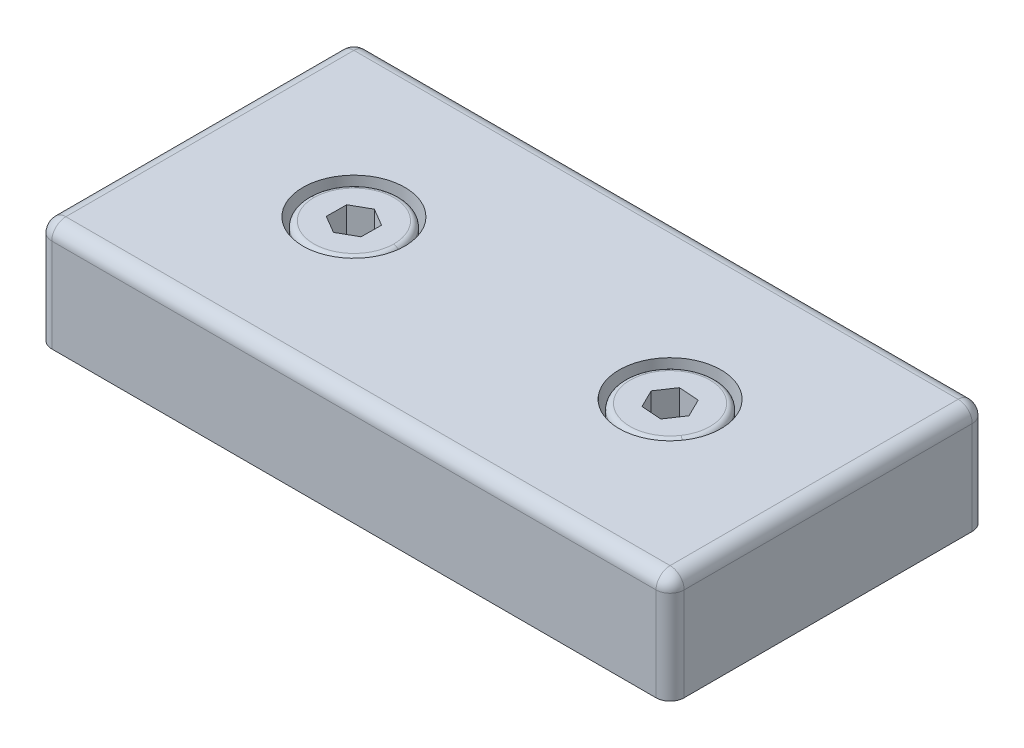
ISO-10303-21;
HEADER;
FILE_DESCRIPTION(('STEP AP214'),'2;1');
FILE_NAME('part.step','',(''),(''),'','','');
FILE_SCHEMA(('AUTOMOTIVE_DESIGN { 1 0 10303 214 1 1 1 1 }'));
ENDSEC;
DATA;
#1=APPLICATION_CONTEXT('core data for automotive mechanical design processes');
#2=APPLICATION_PROTOCOL_DEFINITION('international standard','automotive_design',2000,#1);
#3=PRODUCT_CONTEXT('',#1,'mechanical');
#4=PRODUCT('Part','Part','',(#3));
#5=PRODUCT_RELATED_PRODUCT_CATEGORY('part','',(#4));
#6=PRODUCT_DEFINITION_FORMATION('','',#4);
#7=PRODUCT_DEFINITION_CONTEXT('part definition',#1,'design');
#8=PRODUCT_DEFINITION('design','',#6,#7);
#9=PRODUCT_DEFINITION_SHAPE('','',#8);
#10=(LENGTH_UNIT() NAMED_UNIT(*) SI_UNIT(.MILLI.,.METRE.));
#11=(NAMED_UNIT(*) PLANE_ANGLE_UNIT() SI_UNIT($,.RADIAN.));
#12=(NAMED_UNIT(*) SI_UNIT($,.STERADIAN.) SOLID_ANGLE_UNIT());
#13=UNCERTAINTY_MEASURE_WITH_UNIT(LENGTH_MEASURE(1.E-05),#10,'distance_accuracy_value','');
#14=(GEOMETRIC_REPRESENTATION_CONTEXT(3) GLOBAL_UNCERTAINTY_ASSIGNED_CONTEXT((#13)) GLOBAL_UNIT_ASSIGNED_CONTEXT((#10,
#11,#12)) REPRESENTATION_CONTEXT('',''));
#15=CARTESIAN_POINT('',(0.,0.,0.));
#16=DIRECTION('',(0.,0.,1.));
#17=DIRECTION('',(1.,0.,0.));
#18=AXIS2_PLACEMENT_3D('',#15,#16,#17);
#19=CARTESIAN_POINT('',(666.92108138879,896.153264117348,1298.48598214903));
#20=DIRECTION('',(0.,1.,0.));
#21=DIRECTION('',(-0.999963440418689,0.,-0.00855089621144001));
#22=AXIS2_PLACEMENT_3D('',#19,#20,#21);
#23=CONICAL_SURFACE('',#22,2.5,1.0471975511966);
#24=DIRECTION('',(0.86599374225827,0.5,0.00740529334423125));
#25=VECTOR('',#24,1.);
#26=CARTESIAN_POINT('',(669.420989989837,896.153264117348,1298.50735938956));
#27=LINE('',#26,#25);
#28=CARTESIAN_POINT('',(666.92108138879,894.709888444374,1298.48598214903));
#29=VERTEX_POINT('',#28);
#30=CARTESIAN_POINT('',(669.420989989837,896.153264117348,1298.50735938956));
#31=VERTEX_POINT('',#30);
#32=EDGE_CURVE('P0_E336',#29,#31,#27,.T.);
#33=ORIENTED_EDGE('',*,*,#32,.F.);
#34=DIRECTION('',(-0.86599374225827,0.5,-0.00740529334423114));
#35=VECTOR('',#34,1.);
#36=CARTESIAN_POINT('',(664.421172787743,896.153264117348,1298.46460490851));
#37=LINE('',#36,#35);
#38=CARTESIAN_POINT('',(664.421172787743,896.153264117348,1298.46460490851));
#39=VERTEX_POINT('',#38);
#40=EDGE_CURVE('P0_E338',#29,#39,#37,.T.);
#41=ORIENTED_EDGE('',*,*,#40,.T.);
#42=CARTESIAN_POINT('',(666.92108138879,896.153264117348,1298.48598214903));
#43=DIRECTION('',(0.,1.,0.));
#44=DIRECTION('',(-0.999963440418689,0.,-0.00855089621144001));
#45=AXIS2_PLACEMENT_3D('',#42,#43,#44);
#46=CIRCLE('',#45,2.5);
#47=CARTESIAN_POINT('',(665.652613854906,896.153264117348,1300.64027788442));
#48=VERTEX_POINT('',#47);
#49=EDGE_CURVE('P0_E11',#39,#48,#46,.T.);
#50=ORIENTED_EDGE('',*,*,#49,.T.);
#51=CARTESIAN_POINT('',(666.92108138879,896.153264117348,1298.48598214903));
#52=DIRECTION('',(0.,1.,0.));
#53=DIRECTION('',(-0.999963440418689,0.,-0.00855089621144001));
#54=AXIS2_PLACEMENT_3D('',#51,#52,#53);
#55=CIRCLE('',#54,2.5);
#56=CARTESIAN_POINT('',(668.152522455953,896.153264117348,1300.66165512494));
#57=VERTEX_POINT('',#56);
#58=EDGE_CURVE('P0_E28',#48,#57,#55,.T.);
#59=ORIENTED_EDGE('',*,*,#58,.T.);
#60=CARTESIAN_POINT('',(666.92108138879,896.153264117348,1298.48598214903));
#61=DIRECTION('',(0.,1.,0.));
#62=DIRECTION('',(-0.999963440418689,0.,-0.00855089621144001));
#63=AXIS2_PLACEMENT_3D('',#60,#61,#62);
#64=CIRCLE('',#63,2.5);
#65=EDGE_CURVE('P0_E21',#57,#31,#64,.T.);
#66=ORIENTED_EDGE('',*,*,#65,.T.);
#67=EDGE_LOOP('',(#33,#41,#50,#59,#66));
#68=FACE_BOUND('',#67,.T.);
#69=ADVANCED_FACE('P0_F18',(#68),#23,.F.);
#70=CARTESIAN_POINT('',(664.40883063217,896.153264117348,1299.90792781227));
#71=DIRECTION('',(0.,1.,0.));
#72=DIRECTION('',(-0.999963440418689,0.,-0.00855089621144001));
#73=AXIS2_PLACEMENT_3D('',#70,#71,#72);
#74=PLANE('',#73);
#75=ORIENTED_EDGE('',*,*,#49,.F.);
#76=DIRECTION('',(-0.00855089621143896,0.,0.999963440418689));
#77=VECTOR('',#76,1.);
#78=CARTESIAN_POINT('',(664.433514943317,896.153264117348,1297.02128200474));
#79=LINE('',#78,#77);
#80=CARTESIAN_POINT('',(664.40883063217,896.153264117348,1299.90792781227));
#81=VERTEX_POINT('',#80);
#82=EDGE_CURVE('P0_E298',#39,#81,#79,.T.);
#83=ORIENTED_EDGE('',*,*,#82,.T.);
#84=DIRECTION('',(-0.861718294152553,0.,-0.507387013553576));
#85=VECTOR('',#84,1.);
#86=CARTESIAN_POINT('',(666.896397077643,896.153264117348,1301.37262795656));
#87=LINE('',#86,#85);
#88=EDGE_CURVE('P0_E280',#48,#81,#87,.T.);
#89=ORIENTED_EDGE('',*,*,#88,.F.);
#90=EDGE_LOOP('',(#75,#83,#89));
#91=FACE_BOUND('',#90,.T.);
#92=ADVANCED_FACE('P0_F576',(#91),#74,.T.);
#93=CARTESIAN_POINT('',(664.40883063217,896.153264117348,1299.90792781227));
#94=DIRECTION('',(0.,1.,0.));
#95=DIRECTION('',(-0.999963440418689,0.,-0.00855089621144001));
#96=AXIS2_PLACEMENT_3D('',#93,#94,#95);
#97=PLANE('',#96);
#98=ORIENTED_EDGE('',*,*,#58,.F.);
#99=DIRECTION('',(-0.861718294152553,0.,-0.507387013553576));
#100=VECTOR('',#99,1.);
#101=CARTESIAN_POINT('',(666.896397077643,896.153264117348,1301.37262795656));
#102=LINE('',#101,#100);
#103=CARTESIAN_POINT('',(666.896397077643,896.153264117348,1301.37262795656));
#104=VERTEX_POINT('',#103);
#105=EDGE_CURVE('P0_E277',#104,#48,#102,.T.);
#106=ORIENTED_EDGE('',*,*,#105,.F.);
#107=DIRECTION('',(0.870269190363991,0.,-0.492576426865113));
#108=VECTOR('',#107,1.);
#109=CARTESIAN_POINT('',(666.896397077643,896.153264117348,1301.37262795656));
#110=LINE('',#109,#108);
#111=EDGE_CURVE('P0_E210',#104,#57,#110,.T.);
#112=ORIENTED_EDGE('',*,*,#111,.T.);
#113=EDGE_LOOP('',(#98,#106,#112));
#114=FACE_BOUND('',#113,.T.);
#115=ADVANCED_FACE('P0_F585',(#114),#97,.T.);
#116=CARTESIAN_POINT('',(664.40883063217,896.153264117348,1299.90792781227));
#117=DIRECTION('',(0.,1.,0.));
#118=DIRECTION('',(-0.999963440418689,0.,-0.00855089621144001));
#119=AXIS2_PLACEMENT_3D('',#116,#117,#118);
#120=PLANE('',#119);
#121=ORIENTED_EDGE('',*,*,#65,.F.);
#122=DIRECTION('',(0.870269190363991,0.,-0.492576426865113));
#123=VECTOR('',#122,1.);
#124=CARTESIAN_POINT('',(666.896397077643,896.153264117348,1301.37262795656));
#125=LINE('',#124,#123);
#126=CARTESIAN_POINT('',(669.408647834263,896.153264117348,1299.95068229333));
#127=VERTEX_POINT('',#126);
#128=EDGE_CURVE('P0_E208',#57,#127,#125,.T.);
#129=ORIENTED_EDGE('',*,*,#128,.T.);
#130=DIRECTION('',(0.00855089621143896,0.,-0.999963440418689));
#131=VECTOR('',#130,1.);
#132=CARTESIAN_POINT('',(669.408647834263,896.153264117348,1299.95068229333));
#133=LINE('',#132,#131);
#134=EDGE_CURVE('P0_E177',#127,#31,#133,.T.);
#135=ORIENTED_EDGE('',*,*,#134,.T.);
#136=EDGE_LOOP('',(#121,#129,#135));
#137=FACE_BOUND('',#136,.T.);
#138=ADVANCED_FACE('P0_F594',(#137),#120,.T.);
#139=CARTESIAN_POINT('',(664.40883063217,896.153264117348,1299.90792781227));
#140=DIRECTION('',(0.,1.,0.));
#141=DIRECTION('',(-0.999963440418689,0.,-0.00855089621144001));
#142=AXIS2_PLACEMENT_3D('',#139,#140,#141);
#143=PLANE('',#142);
#144=CARTESIAN_POINT('',(666.92108138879,896.153264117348,1298.48598214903));
#145=DIRECTION('',(0.,1.,0.));
#146=DIRECTION('',(-0.999963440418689,0.,-0.00855089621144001));
#147=AXIS2_PLACEMENT_3D('',#144,#145,#146);
#148=CIRCLE('',#147,2.5);
#149=CARTESIAN_POINT('',(668.189548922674,896.153264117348,1296.33168641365));
#150=VERTEX_POINT('',#149);
#151=EDGE_CURVE('P0_E172',#31,#150,#148,.T.);
#152=ORIENTED_EDGE('',*,*,#151,.F.);
#153=DIRECTION('',(0.00855089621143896,0.,-0.999963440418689));
#154=VECTOR('',#153,1.);
#155=CARTESIAN_POINT('',(669.408647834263,896.153264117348,1299.95068229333));
#156=LINE('',#155,#154);
#157=CARTESIAN_POINT('',(669.433332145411,896.153264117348,1297.0640364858));
#158=VERTEX_POINT('',#157);
#159=EDGE_CURVE('P0_E165',#31,#158,#156,.T.);
#160=ORIENTED_EDGE('',*,*,#159,.T.);
#161=DIRECTION('',(0.861718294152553,0.,0.507387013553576));
#162=VECTOR('',#161,1.);
#163=CARTESIAN_POINT('',(666.945765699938,896.153264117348,1295.59933634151));
#164=LINE('',#163,#162);
#165=EDGE_CURVE('P0_E169',#150,#158,#164,.T.);
#166=ORIENTED_EDGE('',*,*,#165,.F.);
#167=EDGE_LOOP('',(#152,#160,#166));
#168=FACE_BOUND('',#167,.T.);
#169=ADVANCED_FACE('P0_F167',(#168),#143,.T.);
#170=CARTESIAN_POINT('',(664.40883063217,896.153264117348,1299.90792781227));
#171=DIRECTION('',(0.,1.,0.));
#172=DIRECTION('',(-0.999963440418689,0.,-0.00855089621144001));
#173=AXIS2_PLACEMENT_3D('',#170,#171,#172);
#174=PLANE('',#173);
#175=CARTESIAN_POINT('',(666.92108138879,896.153264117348,1298.48598214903));
#176=DIRECTION('',(0.,1.,0.));
#177=DIRECTION('',(-0.999963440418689,0.,-0.00855089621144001));
#178=AXIS2_PLACEMENT_3D('',#175,#176,#177);
#179=CIRCLE('',#178,2.5);
#180=CARTESIAN_POINT('',(665.689640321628,896.153264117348,1296.31030917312));
#181=VERTEX_POINT('',#180);
#182=EDGE_CURVE('P0_E321',#150,#181,#179,.T.);
#183=ORIENTED_EDGE('',*,*,#182,.F.);
#184=DIRECTION('',(0.861718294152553,0.,0.507387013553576));
#185=VECTOR('',#184,1.);
#186=CARTESIAN_POINT('',(666.945765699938,896.153264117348,1295.59933634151));
#187=LINE('',#186,#185);
#188=CARTESIAN_POINT('',(666.945765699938,896.153264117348,1295.59933634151));
#189=VERTEX_POINT('',#188);
#190=EDGE_CURVE('P0_E191',#189,#150,#187,.T.);
#191=ORIENTED_EDGE('',*,*,#190,.F.);
#192=DIRECTION('',(0.870269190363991,0.,-0.492576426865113));
#193=VECTOR('',#192,1.);
#194=CARTESIAN_POINT('',(664.433514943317,896.153264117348,1297.02128200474));
#195=LINE('',#194,#193);
#196=EDGE_CURVE('P0_E295',#181,#189,#195,.T.);
#197=ORIENTED_EDGE('',*,*,#196,.F.);
#198=EDGE_LOOP('',(#183,#191,#197));
#199=FACE_BOUND('',#198,.T.);
#200=ADVANCED_FACE('P0_F319',(#199),#174,.T.);
#201=CARTESIAN_POINT('',(664.40883063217,896.153264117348,1299.90792781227));
#202=DIRECTION('',(0.,1.,0.));
#203=DIRECTION('',(-0.999963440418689,0.,-0.00855089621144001));
#204=AXIS2_PLACEMENT_3D('',#201,#202,#203);
#205=PLANE('',#204);
#206=CARTESIAN_POINT('',(666.92108138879,896.153264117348,1298.48598214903));
#207=DIRECTION('',(0.,1.,0.));
#208=DIRECTION('',(-0.999963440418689,0.,-0.00855089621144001));
#209=AXIS2_PLACEMENT_3D('',#206,#207,#208);
#210=CIRCLE('',#209,2.5);
#211=EDGE_CURVE('P0_E346',#181,#39,#210,.T.);
#212=ORIENTED_EDGE('',*,*,#211,.F.);
#213=DIRECTION('',(0.870269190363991,0.,-0.492576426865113));
#214=VECTOR('',#213,1.);
#215=CARTESIAN_POINT('',(664.433514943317,896.153264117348,1297.02128200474));
#216=LINE('',#215,#214);
#217=CARTESIAN_POINT('',(664.433514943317,896.153264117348,1297.02128200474));
#218=VERTEX_POINT('',#217);
#219=EDGE_CURVE('P0_E305',#218,#181,#216,.T.);
#220=ORIENTED_EDGE('',*,*,#219,.F.);
#221=DIRECTION('',(-0.00855089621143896,0.,0.999963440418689));
#222=VECTOR('',#221,1.);
#223=CARTESIAN_POINT('',(664.433514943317,896.153264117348,1297.02128200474));
#224=LINE('',#223,#222);
#225=EDGE_CURVE('P0_E300',#218,#39,#224,.T.);
#226=ORIENTED_EDGE('',*,*,#225,.T.);
#227=EDGE_LOOP('',(#212,#220,#226));
#228=FACE_BOUND('',#227,.T.);
#229=ADVANCED_FACE('P0_F616',(#228),#205,.T.);
#230=CARTESIAN_POINT('',(666.896397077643,896.153264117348,1301.37262795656));
#231=DIRECTION('',(0.492576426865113,0.,0.870269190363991));
#232=DIRECTION('',(0.,1.,0.));
#233=AXIS2_PLACEMENT_3D('',#230,#231,#232);
#234=PLANE('',#233);
#235=DIRECTION('',(0.870269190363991,0.,-0.492576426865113));
#236=VECTOR('',#235,1.);
#237=CARTESIAN_POINT('',(666.896397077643,899.953264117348,1301.37262795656));
#238=LINE('',#237,#236);
#239=CARTESIAN_POINT('',(666.896397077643,899.953264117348,1301.37262795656));
#240=VERTEX_POINT('',#239);
#241=CARTESIAN_POINT('',(669.408647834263,899.953264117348,1299.95068229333));
#242=VERTEX_POINT('',#241);
#243=EDGE_CURVE('P0_E266',#240,#242,#238,.T.);
#244=ORIENTED_EDGE('',*,*,#243,.T.);
#245=DIRECTION('',(0.,1.,0.));
#246=VECTOR('',#245,1.);
#247=CARTESIAN_POINT('',(669.408647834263,896.153264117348,1299.95068229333));
#248=LINE('',#247,#246);
#249=EDGE_CURVE('P0_E206',#127,#242,#248,.T.);
#250=ORIENTED_EDGE('',*,*,#249,.F.);
#251=ORIENTED_EDGE('',*,*,#128,.F.);
#252=ORIENTED_EDGE('',*,*,#111,.F.);
#253=DIRECTION('',(0.,1.,0.));
#254=VECTOR('',#253,1.);
#255=CARTESIAN_POINT('',(666.896397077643,896.153264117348,1301.37262795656));
#256=LINE('',#255,#254);
#257=EDGE_CURVE('P0_E281',#104,#240,#256,.T.);
#258=ORIENTED_EDGE('',*,*,#257,.T.);
#259=EDGE_LOOP('',(#244,#250,#251,#252,#258));
#260=FACE_BOUND('',#259,.T.);
#261=ADVANCED_FACE('P0_F624',(#260),#234,.F.);
#262=CARTESIAN_POINT('',(669.408647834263,896.153264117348,1299.95068229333));
#263=DIRECTION('',(0.999963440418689,0.,0.00855089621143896));
#264=DIRECTION('',(0.00855089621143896,0.,-0.999963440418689));
#265=AXIS2_PLACEMENT_3D('',#262,#263,#264);
#266=PLANE('',#265);
#267=DIRECTION('',(0.00855089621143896,0.,-0.999963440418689));
#268=VECTOR('',#267,1.);
#269=CARTESIAN_POINT('',(669.408647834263,899.953264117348,1299.95068229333));
#270=LINE('',#269,#268);
#271=CARTESIAN_POINT('',(669.433332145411,899.953264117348,1297.0640364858));
#272=VERTEX_POINT('',#271);
#273=EDGE_CURVE('P0_E183',#242,#272,#270,.T.);
#274=ORIENTED_EDGE('',*,*,#273,.T.);
#275=DIRECTION('',(0.,1.,0.));
#276=VECTOR('',#275,1.);
#277=CARTESIAN_POINT('',(669.433332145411,896.153264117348,1297.0640364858));
#278=LINE('',#277,#276);
#279=EDGE_CURVE('P0_E178',#158,#272,#278,.T.);
#280=ORIENTED_EDGE('',*,*,#279,.F.);
#281=ORIENTED_EDGE('',*,*,#159,.F.);
#282=ORIENTED_EDGE('',*,*,#134,.F.);
#283=ORIENTED_EDGE('',*,*,#249,.T.);
#284=EDGE_LOOP('',(#274,#280,#281,#282,#283));
#285=FACE_BOUND('',#284,.T.);
#286=ADVANCED_FACE('P0_F181',(#285),#266,.F.);
#287=CARTESIAN_POINT('',(666.945765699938,896.153264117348,1295.59933634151));
#288=DIRECTION('',(-0.507387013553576,0.,0.861718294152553));
#289=DIRECTION('',(0.,-1.,0.));
#290=AXIS2_PLACEMENT_3D('',#287,#288,#289);
#291=PLANE('',#290);
#292=DIRECTION('',(0.861718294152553,0.,0.507387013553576));
#293=VECTOR('',#292,1.);
#294=CARTESIAN_POINT('',(666.945765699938,899.953264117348,1295.59933634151));
#295=LINE('',#294,#293);
#296=CARTESIAN_POINT('',(666.945765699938,899.953264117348,1295.59933634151));
#297=VERTEX_POINT('',#296);
#298=EDGE_CURVE('P0_E260',#297,#272,#295,.T.);
#299=ORIENTED_EDGE('',*,*,#298,.F.);
#300=DIRECTION('',(0.,1.,0.));
#301=VECTOR('',#300,1.);
#302=CARTESIAN_POINT('',(666.945765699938,896.153264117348,1295.59933634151));
#303=LINE('',#302,#301);
#304=EDGE_CURVE('P0_E200',#189,#297,#303,.T.);
#305=ORIENTED_EDGE('',*,*,#304,.F.);
#306=ORIENTED_EDGE('',*,*,#190,.T.);
#307=ORIENTED_EDGE('',*,*,#165,.T.);
#308=ORIENTED_EDGE('',*,*,#279,.T.);
#309=EDGE_LOOP('',(#299,#305,#306,#307,#308));
#310=FACE_BOUND('',#309,.T.);
#311=ADVANCED_FACE('P0_F189',(#310),#291,.T.);
#312=CARTESIAN_POINT('',(664.433514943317,896.153264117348,1297.02128200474));
#313=DIRECTION('',(0.492576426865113,0.,0.870269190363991));
#314=DIRECTION('',(0.,1.,0.));
#315=AXIS2_PLACEMENT_3D('',#312,#313,#314);
#316=PLANE('',#315);
#317=DIRECTION('',(0.870269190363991,0.,-0.492576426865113));
#318=VECTOR('',#317,1.);
#319=CARTESIAN_POINT('',(664.433514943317,899.953264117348,1297.02128200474));
#320=LINE('',#319,#318);
#321=CARTESIAN_POINT('',(664.433514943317,899.953264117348,1297.02128200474));
#322=VERTEX_POINT('',#321);
#323=EDGE_CURVE('P0_E263',#322,#297,#320,.T.);
#324=ORIENTED_EDGE('',*,*,#323,.F.);
#325=DIRECTION('',(0.,1.,0.));
#326=VECTOR('',#325,1.);
#327=CARTESIAN_POINT('',(664.433514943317,896.153264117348,1297.02128200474));
#328=LINE('',#327,#326);
#329=EDGE_CURVE('P0_E304',#218,#322,#328,.T.);
#330=ORIENTED_EDGE('',*,*,#329,.F.);
#331=ORIENTED_EDGE('',*,*,#219,.T.);
#332=ORIENTED_EDGE('',*,*,#196,.T.);
#333=ORIENTED_EDGE('',*,*,#304,.T.);
#334=EDGE_LOOP('',(#324,#330,#331,#332,#333));
#335=FACE_BOUND('',#334,.T.);
#336=ADVANCED_FACE('P0_F315',(#335),#316,.T.);
#337=CARTESIAN_POINT('',(664.433514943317,896.153264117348,1297.02128200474));
#338=DIRECTION('',(-0.999963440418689,0.,-0.00855089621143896));
#339=DIRECTION('',(0.00855089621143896,0.,-0.999963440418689));
#340=AXIS2_PLACEMENT_3D('',#337,#338,#339);
#341=PLANE('',#340);
#342=DIRECTION('',(-0.00855089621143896,0.,0.999963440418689));
#343=VECTOR('',#342,1.);
#344=CARTESIAN_POINT('',(664.433514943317,899.953264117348,1297.02128200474));
#345=LINE('',#344,#343);
#346=CARTESIAN_POINT('',(664.40883063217,899.953264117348,1299.90792781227));
#347=VERTEX_POINT('',#346);
#348=EDGE_CURVE('P0_E257',#322,#347,#345,.T.);
#349=ORIENTED_EDGE('',*,*,#348,.T.);
#350=DIRECTION('',(0.,1.,0.));
#351=VECTOR('',#350,1.);
#352=CARTESIAN_POINT('',(664.40883063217,896.153264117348,1299.90792781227));
#353=LINE('',#352,#351);
#354=EDGE_CURVE('P0_E292',#81,#347,#353,.T.);
#355=ORIENTED_EDGE('',*,*,#354,.F.);
#356=ORIENTED_EDGE('',*,*,#82,.F.);
#357=ORIENTED_EDGE('',*,*,#225,.F.);
#358=ORIENTED_EDGE('',*,*,#329,.T.);
#359=EDGE_LOOP('',(#349,#355,#356,#357,#358));
#360=FACE_BOUND('',#359,.T.);
#361=ADVANCED_FACE('P0_F655',(#360),#341,.F.);
#362=CARTESIAN_POINT('',(666.896397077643,896.153264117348,1301.37262795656));
#363=DIRECTION('',(0.507387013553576,0.,-0.861718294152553));
#364=DIRECTION('',(0.861718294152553,0.,0.507387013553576));
#365=AXIS2_PLACEMENT_3D('',#362,#363,#364);
#366=PLANE('',#365);
#367=DIRECTION('',(-0.861718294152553,0.,-0.507387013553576));
#368=VECTOR('',#367,1.);
#369=CARTESIAN_POINT('',(666.896397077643,899.953264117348,1301.37262795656));
#370=LINE('',#369,#368);
#371=EDGE_CURVE('P0_E253',#240,#347,#370,.T.);
#372=ORIENTED_EDGE('',*,*,#371,.F.);
#373=ORIENTED_EDGE('',*,*,#257,.F.);
#374=ORIENTED_EDGE('',*,*,#105,.T.);
#375=ORIENTED_EDGE('',*,*,#88,.T.);
#376=ORIENTED_EDGE('',*,*,#354,.T.);
#377=EDGE_LOOP('',(#372,#373,#374,#375,#376));
#378=FACE_BOUND('',#377,.T.);
#379=ADVANCED_FACE('P0_F663',(#378),#366,.T.);
#380=CARTESIAN_POINT('',(666.92108138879,899.153264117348,1298.48598214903));
#381=DIRECTION('',(0.,1.,0.));
#382=DIRECTION('',(-0.999963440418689,0.,-0.00855089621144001));
#383=AXIS2_PLACEMENT_3D('',#380,#381,#382);
#384=TOROIDAL_SURFACE('',#383,5.7,0.8);
#385=CARTESIAN_POINT('',(672.620872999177,899.153264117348,1298.53472225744));
#386=DIRECTION('',(-0.00855089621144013,0.,0.999963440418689));
#387=DIRECTION('',(-0.999963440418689,0.,-0.00855089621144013));
#388=AXIS2_PLACEMENT_3D('',#385,#386,#387);
#389=CIRCLE('',#388,0.8);
#390=CARTESIAN_POINT('',(673.420843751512,899.153264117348,1298.54156297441));
#391=VERTEX_POINT('',#390);
#392=CARTESIAN_POINT('',(672.620872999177,899.953264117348,1298.53472225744));
#393=VERTEX_POINT('',#392);
#394=EDGE_CURVE('P0_E345',#391,#393,#389,.T.);
#395=ORIENTED_EDGE('',*,*,#394,.F.);
#396=CARTESIAN_POINT('',(666.92108138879,899.153264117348,1298.48598214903));
#397=DIRECTION('',(0.,-1.,0.));
#398=DIRECTION('',(-0.999963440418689,0.,-0.00855089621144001));
#399=AXIS2_PLACEMENT_3D('',#396,#397,#398);
#400=CIRCLE('',#399,6.5);
#401=CARTESIAN_POINT('',(660.421319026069,899.153264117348,1298.43040132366));
#402=VERTEX_POINT('',#401);
#403=EDGE_CURVE('P0_E273',#402,#391,#400,.T.);
#404=ORIENTED_EDGE('',*,*,#403,.F.);
#405=CARTESIAN_POINT('',(661.221289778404,899.153264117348,1298.43724204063));
#406=DIRECTION('',(0.00855089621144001,0.,-0.999963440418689));
#407=DIRECTION('',(0.999963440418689,0.,0.00855089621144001));
#408=AXIS2_PLACEMENT_3D('',#405,#406,#407);
#409=CIRCLE('',#408,0.8);
#410=CARTESIAN_POINT('',(661.221289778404,899.953264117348,1298.43724204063));
#411=VERTEX_POINT('',#410);
#412=EDGE_CURVE('P0_E363',#402,#411,#409,.T.);
#413=ORIENTED_EDGE('',*,*,#412,.T.);
#414=CARTESIAN_POINT('',(666.92108138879,899.953264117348,1298.48598214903));
#415=DIRECTION('',(0.,1.,0.));
#416=DIRECTION('',(-0.999963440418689,0.,-0.00855089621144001));
#417=AXIS2_PLACEMENT_3D('',#414,#415,#416);
#418=CIRCLE('',#417,5.7);
#419=EDGE_CURVE('P0_E250',#393,#411,#418,.T.);
#420=ORIENTED_EDGE('',*,*,#419,.F.);
#421=EDGE_LOOP('',(#395,#404,#413,#420));
#422=FACE_BOUND('',#421,.T.);
#423=ADVANCED_FACE('P0_F672',(#422),#384,.T.);
#424=CARTESIAN_POINT('',(666.92108138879,894.553264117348,1298.48598214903));
#425=DIRECTION('',(0.,-1.,0.));
#426=DIRECTION('',(0.999963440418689,0.,0.00855089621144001));
#427=AXIS2_PLACEMENT_3D('',#424,#425,#426);
#428=TOROIDAL_SURFACE('',#427,4.39999999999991,0.4);
#429=CARTESIAN_POINT('',(662.521242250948,894.553264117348,1298.4483582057));
#430=DIRECTION('',(-0.00855089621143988,0.,0.999963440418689));
#431=DIRECTION('',(-0.999963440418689,0.,-0.00855089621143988));
#432=AXIS2_PLACEMENT_3D('',#429,#430,#431);
#433=CIRCLE('',#432,0.4);
#434=CARTESIAN_POINT('',(662.921227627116,894.553264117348,1298.45177856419));
#435=VERTEX_POINT('',#434);
#436=CARTESIAN_POINT('',(662.521242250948,894.953264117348,1298.4483582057));
#437=VERTEX_POINT('',#436);
#438=EDGE_CURVE('P0_E372',#435,#437,#433,.T.);
#439=ORIENTED_EDGE('',*,*,#438,.F.);
#440=CARTESIAN_POINT('',(666.92108138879,894.553264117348,1298.48598214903));
#441=DIRECTION('',(0.,-1.,0.));
#442=DIRECTION('',(0.999963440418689,0.,0.00855089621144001));
#443=AXIS2_PLACEMENT_3D('',#440,#441,#442);
#444=CIRCLE('',#443,3.99999999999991);
#445=CARTESIAN_POINT('',(670.920935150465,894.553264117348,1298.52018573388));
#446=VERTEX_POINT('',#445);
#447=EDGE_CURVE('P0_E233',#446,#435,#444,.T.);
#448=ORIENTED_EDGE('',*,*,#447,.F.);
#449=CARTESIAN_POINT('',(671.320920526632,894.553264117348,1298.52360609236));
#450=DIRECTION('',(0.00855089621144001,0.,-0.999963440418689));
#451=DIRECTION('',(0.999963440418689,0.,0.00855089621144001));
#452=AXIS2_PLACEMENT_3D('',#449,#450,#451);
#453=CIRCLE('',#452,0.4);
#454=CARTESIAN_POINT('',(671.320920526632,894.953264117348,1298.52360609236));
#455=VERTEX_POINT('',#454);
#456=EDGE_CURVE('P0_E356',#446,#455,#453,.T.);
#457=ORIENTED_EDGE('',*,*,#456,.T.);
#458=CARTESIAN_POINT('',(666.92108138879,894.953264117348,1298.48598214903));
#459=DIRECTION('',(0.,1.,0.));
#460=DIRECTION('',(0.999963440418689,0.,0.00855089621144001));
#461=AXIS2_PLACEMENT_3D('',#458,#459,#460);
#462=CIRCLE('',#461,4.39999999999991);
#463=EDGE_CURVE('P0_E276',#437,#455,#462,.T.);
#464=ORIENTED_EDGE('',*,*,#463,.F.);
#465=EDGE_LOOP('',(#439,#448,#457,#464));
#466=FACE_BOUND('',#465,.T.);
#467=ADVANCED_FACE('P0_F681',(#466),#428,.F.);
#468=CARTESIAN_POINT('',(666.892782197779,869.953264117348,1301.7953611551));
#469=DIRECTION('',(0.,-1.,0.));
#470=DIRECTION('',(-0.00855089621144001,0.,0.999963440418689));
#471=AXIS2_PLACEMENT_3D('',#468,#469,#470);
#472=PLANE('',#471);
#473=CARTESIAN_POINT('',(666.92108138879,869.953264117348,1298.48598214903));
#474=DIRECTION('',(0.,1.,0.));
#475=DIRECTION('',(-0.999963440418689,0.,-0.00855089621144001));
#476=AXIS2_PLACEMENT_3D('',#473,#474,#475);
#477=CIRCLE('',#476,3.3095);
#478=CARTESIAN_POINT('',(663.611702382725,869.953264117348,1298.45768295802));
#479=VERTEX_POINT('',#478);
#480=CARTESIAN_POINT('',(670.230460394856,869.953264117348,1298.51428134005));
#481=VERTEX_POINT('',#480);
#482=EDGE_CURVE('P0_E352',#479,#481,#477,.T.);
#483=ORIENTED_EDGE('',*,*,#482,.F.);
#484=CARTESIAN_POINT('',(666.92108138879,869.953264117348,1298.48598214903));
#485=DIRECTION('',(0.,1.,0.));
#486=DIRECTION('',(-0.999963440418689,0.,-0.00855089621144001));
#487=AXIS2_PLACEMENT_3D('',#484,#485,#486);
#488=CIRCLE('',#487,3.3095);
#489=EDGE_CURVE('P0_E285',#481,#479,#488,.T.);
#490=ORIENTED_EDGE('',*,*,#489,.F.);
#491=EDGE_LOOP('',(#483,#490));
#492=FACE_BOUND('',#491,.T.);
#493=ADVANCED_FACE('P0_F690',(#492),#472,.T.);
#494=CARTESIAN_POINT('',(666.92108138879,869.953264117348,1298.48598214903));
#495=DIRECTION('',(0.,1.,0.));
#496=DIRECTION('',(-0.999963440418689,0.,-0.00855089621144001));
#497=AXIS2_PLACEMENT_3D('',#494,#495,#496);
#498=CONICAL_SURFACE('',#497,3.3095,0.785398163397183);
#499=DIRECTION('',(0.707080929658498,0.707106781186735,0.00604639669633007));
#500=VECTOR('',#499,1.);
#501=CARTESIAN_POINT('',(670.230460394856,869.953264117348,1298.51428134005));
#502=LINE('',#501,#500);
#503=CARTESIAN_POINT('',(670.920935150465,870.643764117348,1298.52018573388));
#504=VERTEX_POINT('',#503);
#505=EDGE_CURVE('P0_E347',#481,#504,#502,.T.);
#506=ORIENTED_EDGE('',*,*,#505,.F.);
#507=ORIENTED_EDGE('',*,*,#489,.T.);
#508=DIRECTION('',(-0.707080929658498,0.707106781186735,-0.00604639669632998));
#509=VECTOR('',#508,1.);
#510=CARTESIAN_POINT('',(663.611702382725,869.953264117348,1298.45768295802));
#511=LINE('',#510,#509);
#512=CARTESIAN_POINT('',(662.921227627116,870.643764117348,1298.45177856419));
#513=VERTEX_POINT('',#512);
#514=EDGE_CURVE('P0_E383',#479,#513,#511,.T.);
#515=ORIENTED_EDGE('',*,*,#514,.T.);
#516=CARTESIAN_POINT('',(666.92108138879,870.643764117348,1298.48598214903));
#517=DIRECTION('',(0.,1.,0.));
#518=DIRECTION('',(-0.999963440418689,0.,-0.00855089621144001));
#519=AXIS2_PLACEMENT_3D('',#516,#517,#518);
#520=CIRCLE('',#519,3.99999999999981);
#521=EDGE_CURVE('P0_E282',#504,#513,#520,.T.);
#522=ORIENTED_EDGE('',*,*,#521,.F.);
#523=EDGE_LOOP('',(#506,#507,#515,#522));
#524=FACE_BOUND('',#523,.T.);
#525=ADVANCED_FACE('P0_F699',(#524),#498,.T.);
#526=CARTESIAN_POINT('',(666.92108138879,931.703264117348,1298.48598214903));
#527=DIRECTION('',(0.,1.,0.));
#528=DIRECTION('',(-0.999963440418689,0.,-0.00855089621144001));
#529=AXIS2_PLACEMENT_3D('',#526,#527,#528);
#530=CYLINDRICAL_SURFACE('',#529,3.99999999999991);
#531=DIRECTION('',(0.,1.,0.));
#532=VECTOR('',#531,1.);
#533=CARTESIAN_POINT('',(670.920935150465,931.703264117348,1298.52018573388));
#534=LINE('',#533,#532);
#535=EDGE_CURVE('P0_E231',#504,#446,#534,.T.);
#536=ORIENTED_EDGE('',*,*,#535,.F.);
#537=ORIENTED_EDGE('',*,*,#521,.T.);
#538=DIRECTION('',(0.,1.,0.));
#539=VECTOR('',#538,1.);
#540=CARTESIAN_POINT('',(662.921227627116,931.703264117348,1298.45177856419));
#541=LINE('',#540,#539);
#542=EDGE_CURVE('P0_E237',#513,#435,#541,.T.);
#543=ORIENTED_EDGE('',*,*,#542,.T.);
#544=CARTESIAN_POINT('',(666.92108138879,894.553264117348,1298.48598214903));
#545=DIRECTION('',(0.,-1.,0.));
#546=DIRECTION('',(0.999963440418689,0.,0.00855089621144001));
#547=AXIS2_PLACEMENT_3D('',#544,#545,#546);
#548=CIRCLE('',#547,3.99999999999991);
#549=EDGE_CURVE('P0_E366',#435,#446,#548,.T.);
#550=ORIENTED_EDGE('',*,*,#549,.T.);
#551=EDGE_LOOP('',(#536,#537,#543,#550));
#552=FACE_BOUND('',#551,.T.);
#553=ADVANCED_FACE('P0_F408',(#552),#530,.T.);
#554=CARTESIAN_POINT('',(666.865500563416,894.953264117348,1304.98574451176));
#555=DIRECTION('',(0.,-1.,0.));
#556=DIRECTION('',(-0.00855089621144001,0.,0.999963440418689));
#557=AXIS2_PLACEMENT_3D('',#554,#555,#556);
#558=PLANE('',#557);
#559=CARTESIAN_POINT('',(666.92108138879,894.953264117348,1298.48598214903));
#560=DIRECTION('',(0.,1.,0.));
#561=DIRECTION('',(0.999963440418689,0.,0.00855089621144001));
#562=AXIS2_PLACEMENT_3D('',#559,#560,#561);
#563=CIRCLE('',#562,4.39999999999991);
#564=EDGE_CURVE('P0_E376',#455,#437,#563,.T.);
#565=ORIENTED_EDGE('',*,*,#564,.T.);
#566=ORIENTED_EDGE('',*,*,#463,.T.);
#567=EDGE_LOOP('',(#565,#566));
#568=FACE_BOUND('',#567,.T.);
#569=CARTESIAN_POINT('',(666.92108138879,894.953264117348,1298.48598214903));
#570=DIRECTION('',(0.,1.,0.));
#571=DIRECTION('',(-0.999963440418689,0.,-0.00855089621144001));
#572=AXIS2_PLACEMENT_3D('',#569,#570,#571);
#573=CIRCLE('',#572,6.5);
#574=CARTESIAN_POINT('',(660.421319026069,894.953264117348,1298.43040132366));
#575=VERTEX_POINT('',#574);
#576=CARTESIAN_POINT('',(673.420843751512,894.953264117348,1298.54156297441));
#577=VERTEX_POINT('',#576);
#578=EDGE_CURVE('P0_E241',#575,#577,#573,.T.);
#579=ORIENTED_EDGE('',*,*,#578,.F.);
#580=CARTESIAN_POINT('',(666.92108138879,894.953264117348,1298.48598214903));
#581=DIRECTION('',(0.,1.,0.));
#582=DIRECTION('',(-0.999963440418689,0.,-0.00855089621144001));
#583=AXIS2_PLACEMENT_3D('',#580,#581,#582);
#584=CIRCLE('',#583,6.5);
#585=EDGE_CURVE('P0_E270',#577,#575,#584,.T.);
#586=ORIENTED_EDGE('',*,*,#585,.F.);
#587=EDGE_LOOP('',(#579,#586));
#588=FACE_BOUND('',#587,.T.);
#589=ADVANCED_FACE('P0_F715',(#568,#588),#558,.T.);
#590=CARTESIAN_POINT('',(666.92108138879,931.703264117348,1298.48598214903));
#591=DIRECTION('',(0.,1.,0.));
#592=DIRECTION('',(-0.999963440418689,0.,-0.00855089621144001));
#593=AXIS2_PLACEMENT_3D('',#590,#591,#592);
#594=CYLINDRICAL_SURFACE('',#593,6.5);
#595=DIRECTION('',(0.,1.,0.));
#596=VECTOR('',#595,1.);
#597=CARTESIAN_POINT('',(673.420843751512,931.703264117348,1298.54156297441));
#598=LINE('',#597,#596);
#599=EDGE_CURVE('P0_E242',#577,#391,#598,.T.);
#600=ORIENTED_EDGE('',*,*,#599,.F.);
#601=ORIENTED_EDGE('',*,*,#585,.T.);
#602=DIRECTION('',(0.,1.,0.));
#603=VECTOR('',#602,1.);
#604=CARTESIAN_POINT('',(660.421319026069,931.703264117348,1298.43040132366));
#605=LINE('',#604,#603);
#606=EDGE_CURVE('P0_E246',#575,#402,#605,.T.);
#607=ORIENTED_EDGE('',*,*,#606,.T.);
#608=ORIENTED_EDGE('',*,*,#403,.T.);
#609=EDGE_LOOP('',(#600,#601,#607,#608));
#610=FACE_BOUND('',#609,.T.);
#611=ADVANCED_FACE('P0_F723',(#610),#594,.T.);
#612=CARTESIAN_POINT('',(666.92108138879,899.953264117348,1298.48598214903));
#613=DIRECTION('',(0.,1.,0.));
#614=DIRECTION('',(-0.999963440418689,0.,-0.00855089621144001));
#615=AXIS2_PLACEMENT_3D('',#612,#613,#614);
#616=PLANE('',#615);
#617=ORIENTED_EDGE('',*,*,#371,.T.);
#618=ORIENTED_EDGE('',*,*,#348,.F.);
#619=ORIENTED_EDGE('',*,*,#323,.T.);
#620=ORIENTED_EDGE('',*,*,#298,.T.);
#621=ORIENTED_EDGE('',*,*,#273,.F.);
#622=ORIENTED_EDGE('',*,*,#243,.F.);
#623=EDGE_LOOP('',(#617,#618,#619,#620,#621,#622));
#624=FACE_BOUND('',#623,.T.);
#625=CARTESIAN_POINT('',(666.92108138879,899.953264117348,1298.48598214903));
#626=DIRECTION('',(0.,1.,0.));
#627=DIRECTION('',(-0.999963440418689,0.,-0.00855089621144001));
#628=AXIS2_PLACEMENT_3D('',#625,#626,#627);
#629=CIRCLE('',#628,5.7);
#630=EDGE_CURVE('P0_E360',#411,#393,#629,.T.);
#631=ORIENTED_EDGE('',*,*,#630,.T.);
#632=ORIENTED_EDGE('',*,*,#419,.T.);
#633=EDGE_LOOP('',(#631,#632));
#634=FACE_BOUND('',#633,.T.);
#635=ADVANCED_FACE('P0_F325',(#624,#634),#616,.T.);
#636=CARTESIAN_POINT('',(666.92108138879,931.703264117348,1298.48598214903));
#637=DIRECTION('',(0.,1.,0.));
#638=DIRECTION('',(-0.999963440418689,0.,-0.00855089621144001));
#639=AXIS2_PLACEMENT_3D('',#636,#637,#638);
#640=CYLINDRICAL_SURFACE('',#639,6.5);
#641=ORIENTED_EDGE('',*,*,#578,.T.);
#642=ORIENTED_EDGE('',*,*,#599,.T.);
#643=CARTESIAN_POINT('',(666.92108138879,899.153264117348,1298.48598214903));
#644=DIRECTION('',(0.,-1.,0.));
#645=DIRECTION('',(-0.999963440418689,0.,-0.00855089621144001));
#646=AXIS2_PLACEMENT_3D('',#643,#644,#645);
#647=CIRCLE('',#646,6.5);
#648=EDGE_CURVE('P0_E341',#391,#402,#647,.T.);
#649=ORIENTED_EDGE('',*,*,#648,.T.);
#650=ORIENTED_EDGE('',*,*,#606,.F.);
#651=EDGE_LOOP('',(#641,#642,#649,#650));
#652=FACE_BOUND('',#651,.T.);
#653=ADVANCED_FACE('P0_F740',(#652),#640,.T.);
#654=CARTESIAN_POINT('',(666.92108138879,931.703264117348,1298.48598214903));
#655=DIRECTION('',(0.,1.,0.));
#656=DIRECTION('',(-0.999963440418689,0.,-0.00855089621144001));
#657=AXIS2_PLACEMENT_3D('',#654,#655,#656);
#658=CYLINDRICAL_SURFACE('',#657,3.99999999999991);
#659=CARTESIAN_POINT('',(666.92108138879,870.643764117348,1298.48598214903));
#660=DIRECTION('',(0.,1.,0.));
#661=DIRECTION('',(-0.999963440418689,0.,-0.00855089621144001));
#662=AXIS2_PLACEMENT_3D('',#659,#660,#661);
#663=CIRCLE('',#662,3.99999999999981);
#664=EDGE_CURVE('P0_E351',#513,#504,#663,.T.);
#665=ORIENTED_EDGE('',*,*,#664,.T.);
#666=ORIENTED_EDGE('',*,*,#535,.T.);
#667=ORIENTED_EDGE('',*,*,#447,.T.);
#668=ORIENTED_EDGE('',*,*,#542,.F.);
#669=EDGE_LOOP('',(#665,#666,#667,#668));
#670=FACE_BOUND('',#669,.T.);
#671=ADVANCED_FACE('P0_F748',(#670),#658,.T.);
#672=CARTESIAN_POINT('',(666.92108138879,869.953264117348,1298.48598214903));
#673=DIRECTION('',(0.,1.,0.));
#674=DIRECTION('',(-0.999963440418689,0.,-0.00855089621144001));
#675=AXIS2_PLACEMENT_3D('',#672,#673,#674);
#676=CONICAL_SURFACE('',#675,3.3095,0.785398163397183);
#677=ORIENTED_EDGE('',*,*,#482,.T.);
#678=ORIENTED_EDGE('',*,*,#505,.T.);
#679=ORIENTED_EDGE('',*,*,#664,.F.);
#680=ORIENTED_EDGE('',*,*,#514,.F.);
#681=EDGE_LOOP('',(#677,#678,#679,#680));
#682=FACE_BOUND('',#681,.T.);
#683=ADVANCED_FACE('P0_F757',(#682),#676,.T.);
#684=CARTESIAN_POINT('',(666.92108138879,894.553264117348,1298.48598214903));
#685=DIRECTION('',(0.,-1.,0.));
#686=DIRECTION('',(0.999963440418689,0.,0.00855089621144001));
#687=AXIS2_PLACEMENT_3D('',#684,#685,#686);
#688=TOROIDAL_SURFACE('',#687,4.39999999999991,0.4);
#689=ORIENTED_EDGE('',*,*,#549,.F.);
#690=ORIENTED_EDGE('',*,*,#438,.T.);
#691=ORIENTED_EDGE('',*,*,#564,.F.);
#692=ORIENTED_EDGE('',*,*,#456,.F.);
#693=EDGE_LOOP('',(#689,#690,#691,#692));
#694=FACE_BOUND('',#693,.T.);
#695=ADVANCED_FACE('P0_F411',(#694),#688,.F.);
#696=CARTESIAN_POINT('',(666.92108138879,899.153264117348,1298.48598214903));
#697=DIRECTION('',(0.,1.,0.));
#698=DIRECTION('',(-0.999963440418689,0.,-0.00855089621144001));
#699=AXIS2_PLACEMENT_3D('',#696,#697,#698);
#700=TOROIDAL_SURFACE('',#699,5.7,0.8);
#701=ORIENTED_EDGE('',*,*,#648,.F.);
#702=ORIENTED_EDGE('',*,*,#394,.T.);
#703=ORIENTED_EDGE('',*,*,#630,.F.);
#704=ORIENTED_EDGE('',*,*,#412,.F.);
#705=EDGE_LOOP('',(#701,#702,#703,#704));
#706=FACE_BOUND('',#705,.T.);
#707=ADVANCED_FACE('P0_F773',(#706),#700,.T.);
#708=CARTESIAN_POINT('',(666.92108138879,896.153264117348,1298.48598214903));
#709=DIRECTION('',(0.,1.,0.));
#710=DIRECTION('',(-0.999963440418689,0.,-0.00855089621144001));
#711=AXIS2_PLACEMENT_3D('',#708,#709,#710);
#712=CONICAL_SURFACE('',#711,2.5,1.0471975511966);
#713=ORIENTED_EDGE('',*,*,#40,.F.);
#714=ORIENTED_EDGE('',*,*,#32,.T.);
#715=ORIENTED_EDGE('',*,*,#151,.T.);
#716=ORIENTED_EDGE('',*,*,#182,.T.);
#717=ORIENTED_EDGE('',*,*,#211,.T.);
#718=EDGE_LOOP('',(#713,#714,#715,#716,#717));
#719=FACE_BOUND('',#718,.T.);
#720=ADVANCED_FACE('P0_F781',(#719),#712,.F.);
#721=CLOSED_SHELL('',(#69,#92,#115,#138,#169,#200,#229,#261,#286,#311,#336,#361,#379,#423,#467,
#493,#525,#553,#589,#611,#635,#653,#671,#683,#695,#707,#720));
#722=MANIFOLD_SOLID_BREP('P0_B1',#721);
#723=CARTESIAN_POINT('',(711.92108138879,896.153264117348,1298.48598214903));
#724=DIRECTION('',(0.,1.,0.));
#725=DIRECTION('',(0.831372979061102,0.,0.555714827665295));
#726=AXIS2_PLACEMENT_3D('',#723,#724,#725);
#727=CONICAL_SURFACE('',#726,2.5,1.0471975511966);
#728=DIRECTION('',(-0.719990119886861,0.5,-0.481263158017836));
#729=VECTOR('',#728,1.);
#730=CARTESIAN_POINT('',(709.842648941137,896.153264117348,1297.09669507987));
#731=LINE('',#730,#729);
#732=CARTESIAN_POINT('',(711.92108138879,894.709888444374,1298.48598214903));
#733=VERTEX_POINT('',#732);
#734=CARTESIAN_POINT('',(709.842648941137,896.153264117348,1297.09669507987));
#735=VERTEX_POINT('',#734);
#736=EDGE_CURVE('P1_E335',#733,#735,#731,.T.);
#737=ORIENTED_EDGE('',*,*,#736,.F.);
#738=DIRECTION('',(0.719990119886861,0.5,0.481263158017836));
#739=VECTOR('',#738,1.);
#740=CARTESIAN_POINT('',(713.999513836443,896.153264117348,1299.8752692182));
#741=LINE('',#740,#739);
#742=CARTESIAN_POINT('',(713.999513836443,896.153264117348,1299.8752692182));
#743=VERTEX_POINT('',#742);
#744=EDGE_CURVE('P1_E337',#733,#743,#741,.T.);
#745=ORIENTED_EDGE('',*,*,#744,.T.);
#746=CARTESIAN_POINT('',(711.92108138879,896.153264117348,1298.48598214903));
#747=DIRECTION('',(0.,1.,0.));
#748=DIRECTION('',(0.831372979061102,0.,0.555714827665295));
#749=AXIS2_PLACEMENT_3D('',#746,#747,#748);
#750=CIRCLE('',#749,2.5);
#751=CARTESIAN_POINT('',(714.163455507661,896.153264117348,1297.3806503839));
#752=VERTEX_POINT('',#751);
#753=EDGE_CURVE('P1_E11',#743,#752,#750,.T.);
#754=ORIENTED_EDGE('',*,*,#753,.T.);
#755=CARTESIAN_POINT('',(711.92108138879,896.153264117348,1298.48598214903));
#756=DIRECTION('',(0.,1.,0.));
#757=DIRECTION('',(0.831372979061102,0.,0.555714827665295));
#758=AXIS2_PLACEMENT_3D('',#755,#756,#757);
#759=CIRCLE('',#758,2.5);
#760=CARTESIAN_POINT('',(712.085023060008,896.153264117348,1295.99136331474));
#761=VERTEX_POINT('',#760);
#762=EDGE_CURVE('P1_E28',#752,#761,#759,.T.);
#763=ORIENTED_EDGE('',*,*,#762,.T.);
#764=CARTESIAN_POINT('',(711.92108138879,896.153264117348,1298.48598214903));
#765=DIRECTION('',(0.,1.,0.));
#766=DIRECTION('',(0.831372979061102,0.,0.555714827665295));
#767=AXIS2_PLACEMENT_3D('',#764,#765,#766);
#768=CIRCLE('',#767,2.5);
#769=EDGE_CURVE('P1_E21',#761,#735,#768,.T.);
#770=ORIENTED_EDGE('',*,*,#769,.T.);
#771=EDGE_LOOP('',(#737,#745,#754,#763,#770));
#772=FACE_BOUND('',#771,.T.);
#773=ADVANCED_FACE('P1_F18',(#772),#727,.F.);
#774=CARTESIAN_POINT('',(714.801619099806,896.153264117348,1298.67528568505));
#775=DIRECTION('',(0.,1.,0.));
#776=DIRECTION('',(0.831372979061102,0.,0.555714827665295));
#777=AXIS2_PLACEMENT_3D('',#774,#775,#776);
#778=PLANE('',#777);
#779=ORIENTED_EDGE('',*,*,#753,.F.);
#780=DIRECTION('',(0.555714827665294,0.,-0.831372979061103));
#781=VECTOR('',#780,1.);
#782=CARTESIAN_POINT('',(713.19740857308,896.153264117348,1301.07525275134));
#783=LINE('',#782,#781);
#784=CARTESIAN_POINT('',(714.801619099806,896.153264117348,1298.67528568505));
#785=VERTEX_POINT('',#784);
#786=EDGE_CURVE('P1_E298',#743,#785,#783,.T.);
#787=ORIENTED_EDGE('',*,*,#786,.T.);
#788=DIRECTION('',(0.442132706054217,0.,0.896949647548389));
#789=VECTOR('',#788,1.);
#790=CARTESIAN_POINT('',(713.525291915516,896.153264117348,1296.08601508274));
#791=LINE('',#790,#789);
#792=EDGE_CURVE('P1_E279',#752,#785,#791,.T.);
#793=ORIENTED_EDGE('',*,*,#792,.F.);
#794=EDGE_LOOP('',(#779,#787,#793));
#795=FACE_BOUND('',#794,.T.);
#796=ADVANCED_FACE('P1_F575',(#795),#778,.T.);
#797=CARTESIAN_POINT('',(714.801619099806,896.153264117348,1298.67528568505));
#798=DIRECTION('',(0.,1.,0.));
#799=DIRECTION('',(0.831372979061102,0.,0.555714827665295));
#800=AXIS2_PLACEMENT_3D('',#797,#798,#799);
#801=PLANE('',#800);
#802=ORIENTED_EDGE('',*,*,#762,.F.);
#803=DIRECTION('',(0.442132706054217,0.,0.896949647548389));
#804=VECTOR('',#803,1.);
#805=CARTESIAN_POINT('',(713.525291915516,896.153264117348,1296.08601508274));
#806=LINE('',#805,#804);
#807=CARTESIAN_POINT('',(713.525291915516,896.153264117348,1296.08601508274));
#808=VERTEX_POINT('',#807);
#809=EDGE_CURVE('P1_E275',#808,#752,#806,.T.);
#810=ORIENTED_EDGE('',*,*,#809,.F.);
#811=DIRECTION('',(-0.99784753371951,0.,-0.0655766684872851));
#812=VECTOR('',#811,1.);
#813=CARTESIAN_POINT('',(713.525291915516,896.153264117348,1296.08601508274));
#814=LINE('',#813,#812);
#815=EDGE_CURVE('P1_E210',#808,#761,#814,.T.);
#816=ORIENTED_EDGE('',*,*,#815,.T.);
#817=EDGE_LOOP('',(#802,#810,#816));
#818=FACE_BOUND('',#817,.T.);
#819=ADVANCED_FACE('P1_F584',(#818),#801,.T.);
#820=CARTESIAN_POINT('',(714.801619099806,896.153264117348,1298.67528568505));
#821=DIRECTION('',(0.,1.,0.));
#822=DIRECTION('',(0.831372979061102,0.,0.555714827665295));
#823=AXIS2_PLACEMENT_3D('',#820,#821,#822);
#824=PLANE('',#823);
#825=ORIENTED_EDGE('',*,*,#769,.F.);
#826=DIRECTION('',(-0.99784753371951,0.,-0.0655766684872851));
#827=VECTOR('',#826,1.);
#828=CARTESIAN_POINT('',(713.525291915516,896.153264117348,1296.08601508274));
#829=LINE('',#828,#827);
#830=CARTESIAN_POINT('',(710.6447542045,896.153264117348,1295.89671154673));
#831=VERTEX_POINT('',#830);
#832=EDGE_CURVE('P1_E208',#761,#831,#829,.T.);
#833=ORIENTED_EDGE('',*,*,#832,.T.);
#834=DIRECTION('',(-0.555714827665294,0.,0.831372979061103));
#835=VECTOR('',#834,1.);
#836=CARTESIAN_POINT('',(710.6447542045,896.153264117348,1295.89671154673));
#837=LINE('',#836,#835);
#838=EDGE_CURVE('P1_E177',#831,#735,#837,.T.);
#839=ORIENTED_EDGE('',*,*,#838,.T.);
#840=EDGE_LOOP('',(#825,#833,#839));
#841=FACE_BOUND('',#840,.T.);
#842=ADVANCED_FACE('P1_F593',(#841),#824,.T.);
#843=CARTESIAN_POINT('',(714.801619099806,896.153264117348,1298.67528568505));
#844=DIRECTION('',(0.,1.,0.));
#845=DIRECTION('',(0.831372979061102,0.,0.555714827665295));
#846=AXIS2_PLACEMENT_3D('',#843,#844,#845);
#847=PLANE('',#846);
#848=CARTESIAN_POINT('',(711.92108138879,896.153264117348,1298.48598214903));
#849=DIRECTION('',(0.,1.,0.));
#850=DIRECTION('',(0.831372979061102,0.,0.555714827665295));
#851=AXIS2_PLACEMENT_3D('',#848,#849,#850);
#852=CIRCLE('',#851,2.5);
#853=CARTESIAN_POINT('',(709.678707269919,896.153264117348,1299.59131391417));
#854=VERTEX_POINT('',#853);
#855=EDGE_CURVE('P1_E172',#735,#854,#852,.T.);
#856=ORIENTED_EDGE('',*,*,#855,.F.);
#857=DIRECTION('',(-0.555714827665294,0.,0.831372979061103));
#858=VECTOR('',#857,1.);
#859=CARTESIAN_POINT('',(710.6447542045,896.153264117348,1295.89671154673));
#860=LINE('',#859,#858);
#861=CARTESIAN_POINT('',(709.040543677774,896.153264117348,1298.29667861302));
#862=VERTEX_POINT('',#861);
#863=EDGE_CURVE('P1_E165',#735,#862,#860,.T.);
#864=ORIENTED_EDGE('',*,*,#863,.T.);
#865=DIRECTION('',(-0.442132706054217,0.,-0.896949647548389));
#866=VECTOR('',#865,1.);
#867=CARTESIAN_POINT('',(710.316870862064,896.153264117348,1300.88594921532));
#868=LINE('',#867,#866);
#869=EDGE_CURVE('P1_E169',#854,#862,#868,.T.);
#870=ORIENTED_EDGE('',*,*,#869,.F.);
#871=EDGE_LOOP('',(#856,#864,#870));
#872=FACE_BOUND('',#871,.T.);
#873=ADVANCED_FACE('P1_F167',(#872),#847,.T.);
#874=CARTESIAN_POINT('',(714.801619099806,896.153264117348,1298.67528568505));
#875=DIRECTION('',(0.,1.,0.));
#876=DIRECTION('',(0.831372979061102,0.,0.555714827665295));
#877=AXIS2_PLACEMENT_3D('',#874,#875,#876);
#878=PLANE('',#877);
#879=CARTESIAN_POINT('',(711.92108138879,896.153264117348,1298.48598214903));
#880=DIRECTION('',(0.,1.,0.));
#881=DIRECTION('',(0.831372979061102,0.,0.555714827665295));
#882=AXIS2_PLACEMENT_3D('',#879,#880,#881);
#883=CIRCLE('',#882,2.5);
#884=CARTESIAN_POINT('',(711.757139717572,896.153264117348,1300.98060098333));
#885=VERTEX_POINT('',#884);
#886=EDGE_CURVE('P1_E321',#854,#885,#883,.T.);
#887=ORIENTED_EDGE('',*,*,#886,.F.);
#888=DIRECTION('',(-0.442132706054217,0.,-0.896949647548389));
#889=VECTOR('',#888,1.);
#890=CARTESIAN_POINT('',(710.316870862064,896.153264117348,1300.88594921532));
#891=LINE('',#890,#889);
#892=CARTESIAN_POINT('',(710.316870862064,896.153264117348,1300.88594921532));
#893=VERTEX_POINT('',#892);
#894=EDGE_CURVE('P1_E191',#893,#854,#891,.T.);
#895=ORIENTED_EDGE('',*,*,#894,.F.);
#896=DIRECTION('',(-0.99784753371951,0.,-0.0655766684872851));
#897=VECTOR('',#896,1.);
#898=CARTESIAN_POINT('',(713.19740857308,896.153264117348,1301.07525275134));
#899=LINE('',#898,#897);
#900=EDGE_CURVE('P1_E295',#885,#893,#899,.T.);
#901=ORIENTED_EDGE('',*,*,#900,.F.);
#902=EDGE_LOOP('',(#887,#895,#901));
#903=FACE_BOUND('',#902,.T.);
#904=ADVANCED_FACE('P1_F319',(#903),#878,.T.);
#905=CARTESIAN_POINT('',(714.801619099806,896.153264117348,1298.67528568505));
#906=DIRECTION('',(0.,1.,0.));
#907=DIRECTION('',(0.831372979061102,0.,0.555714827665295));
#908=AXIS2_PLACEMENT_3D('',#905,#906,#907);
#909=PLANE('',#908);
#910=CARTESIAN_POINT('',(711.92108138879,896.153264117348,1298.48598214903));
#911=DIRECTION('',(0.,1.,0.));
#912=DIRECTION('',(0.831372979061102,0.,0.555714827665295));
#913=AXIS2_PLACEMENT_3D('',#910,#911,#912);
#914=CIRCLE('',#913,2.5);
#915=EDGE_CURVE('P1_E345',#885,#743,#914,.T.);
#916=ORIENTED_EDGE('',*,*,#915,.F.);
#917=DIRECTION('',(-0.99784753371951,0.,-0.0655766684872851));
#918=VECTOR('',#917,1.);
#919=CARTESIAN_POINT('',(713.19740857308,896.153264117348,1301.07525275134));
#920=LINE('',#919,#918);
#921=CARTESIAN_POINT('',(713.19740857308,896.153264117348,1301.07525275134));
#922=VERTEX_POINT('',#921);
#923=EDGE_CURVE('P1_E306',#922,#885,#920,.T.);
#924=ORIENTED_EDGE('',*,*,#923,.F.);
#925=DIRECTION('',(0.555714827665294,0.,-0.831372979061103));
#926=VECTOR('',#925,1.);
#927=CARTESIAN_POINT('',(713.19740857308,896.153264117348,1301.07525275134));
#928=LINE('',#927,#926);
#929=EDGE_CURVE('P1_E301',#922,#743,#928,.T.);
#930=ORIENTED_EDGE('',*,*,#929,.T.);
#931=EDGE_LOOP('',(#916,#924,#930));
#932=FACE_BOUND('',#931,.T.);
#933=ADVANCED_FACE('P1_F615',(#932),#909,.T.);
#934=CARTESIAN_POINT('',(713.525291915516,896.153264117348,1296.08601508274));
#935=DIRECTION('',(0.0655766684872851,0.,-0.99784753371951));
#936=DIRECTION('',(0.,1.,0.));
#937=AXIS2_PLACEMENT_3D('',#934,#935,#936);
#938=PLANE('',#937);
#939=DIRECTION('',(-0.99784753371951,0.,-0.0655766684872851));
#940=VECTOR('',#939,1.);
#941=CARTESIAN_POINT('',(713.525291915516,899.953264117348,1296.08601508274));
#942=LINE('',#941,#940);
#943=CARTESIAN_POINT('',(713.525291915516,899.953264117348,1296.08601508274));
#944=VERTEX_POINT('',#943);
#945=CARTESIAN_POINT('',(710.6447542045,899.953264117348,1295.89671154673));
#946=VERTEX_POINT('',#945);
#947=EDGE_CURVE('P1_E264',#944,#946,#942,.T.);
#948=ORIENTED_EDGE('',*,*,#947,.T.);
#949=DIRECTION('',(0.,1.,0.));
#950=VECTOR('',#949,1.);
#951=CARTESIAN_POINT('',(710.6447542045,896.153264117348,1295.89671154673));
#952=LINE('',#951,#950);
#953=EDGE_CURVE('P1_E206',#831,#946,#952,.T.);
#954=ORIENTED_EDGE('',*,*,#953,.F.);
#955=ORIENTED_EDGE('',*,*,#832,.F.);
#956=ORIENTED_EDGE('',*,*,#815,.F.);
#957=DIRECTION('',(0.,1.,0.));
#958=VECTOR('',#957,1.);
#959=CARTESIAN_POINT('',(713.525291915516,896.153264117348,1296.08601508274));
#960=LINE('',#959,#958);
#961=EDGE_CURVE('P1_E280',#808,#944,#960,.T.);
#962=ORIENTED_EDGE('',*,*,#961,.T.);
#963=EDGE_LOOP('',(#948,#954,#955,#956,#962));
#964=FACE_BOUND('',#963,.T.);
#965=ADVANCED_FACE('P1_F623',(#964),#938,.F.);
#966=CARTESIAN_POINT('',(710.6447542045,896.153264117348,1295.89671154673));
#967=DIRECTION('',(-0.831372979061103,0.,-0.555714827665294));
#968=DIRECTION('',(-0.555714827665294,0.,0.831372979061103));
#969=AXIS2_PLACEMENT_3D('',#966,#967,#968);
#970=PLANE('',#969);
#971=DIRECTION('',(-0.555714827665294,0.,0.831372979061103));
#972=VECTOR('',#971,1.);
#973=CARTESIAN_POINT('',(710.6447542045,899.953264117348,1295.89671154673));
#974=LINE('',#973,#972);
#975=CARTESIAN_POINT('',(709.040543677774,899.953264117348,1298.29667861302));
#976=VERTEX_POINT('',#975);
#977=EDGE_CURVE('P1_E183',#946,#976,#974,.T.);
#978=ORIENTED_EDGE('',*,*,#977,.T.);
#979=DIRECTION('',(0.,1.,0.));
#980=VECTOR('',#979,1.);
#981=CARTESIAN_POINT('',(709.040543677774,896.153264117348,1298.29667861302));
#982=LINE('',#981,#980);
#983=EDGE_CURVE('P1_E178',#862,#976,#982,.T.);
#984=ORIENTED_EDGE('',*,*,#983,.F.);
#985=ORIENTED_EDGE('',*,*,#863,.F.);
#986=ORIENTED_EDGE('',*,*,#838,.F.);
#987=ORIENTED_EDGE('',*,*,#953,.T.);
#988=EDGE_LOOP('',(#978,#984,#985,#986,#987));
#989=FACE_BOUND('',#988,.T.);
#990=ADVANCED_FACE('P1_F181',(#989),#970,.F.);
#991=CARTESIAN_POINT('',(710.316870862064,896.153264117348,1300.88594921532));
#992=DIRECTION('',(0.896949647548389,0.,-0.442132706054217));
#993=DIRECTION('',(0.,-1.,0.));
#994=AXIS2_PLACEMENT_3D('',#991,#992,#993);
#995=PLANE('',#994);
#996=DIRECTION('',(-0.442132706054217,0.,-0.896949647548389));
#997=VECTOR('',#996,1.);
#998=CARTESIAN_POINT('',(710.316870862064,899.953264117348,1300.88594921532));
#999=LINE('',#998,#997);
#1000=CARTESIAN_POINT('',(710.316870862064,899.953264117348,1300.88594921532));
#1001=VERTEX_POINT('',#1000);
#1002=EDGE_CURVE('P1_E259',#1001,#976,#999,.T.);
#1003=ORIENTED_EDGE('',*,*,#1002,.F.);
#1004=DIRECTION('',(0.,1.,0.));
#1005=VECTOR('',#1004,1.);
#1006=CARTESIAN_POINT('',(710.316870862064,896.153264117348,1300.88594921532));
#1007=LINE('',#1006,#1005);
#1008=EDGE_CURVE('P1_E200',#893,#1001,#1007,.T.);
#1009=ORIENTED_EDGE('',*,*,#1008,.F.);
#1010=ORIENTED_EDGE('',*,*,#894,.T.);
#1011=ORIENTED_EDGE('',*,*,#869,.T.);
#1012=ORIENTED_EDGE('',*,*,#983,.T.);
#1013=EDGE_LOOP('',(#1003,#1009,#1010,#1011,#1012));
#1014=FACE_BOUND('',#1013,.T.);
#1015=ADVANCED_FACE('P1_F189',(#1014),#995,.T.);
#1016=CARTESIAN_POINT('',(713.19740857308,896.153264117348,1301.07525275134));
#1017=DIRECTION('',(0.0655766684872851,0.,-0.99784753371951));
#1018=DIRECTION('',(0.,1.,0.));
#1019=AXIS2_PLACEMENT_3D('',#1016,#1017,#1018);
#1020=PLANE('',#1019);
#1021=DIRECTION('',(-0.99784753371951,0.,-0.0655766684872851));
#1022=VECTOR('',#1021,1.);
#1023=CARTESIAN_POINT('',(713.19740857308,899.953264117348,1301.07525275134));
#1024=LINE('',#1023,#1022);
#1025=CARTESIAN_POINT('',(713.19740857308,899.953264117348,1301.07525275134));
#1026=VERTEX_POINT('',#1025);
#1027=EDGE_CURVE('P1_E262',#1026,#1001,#1024,.T.);
#1028=ORIENTED_EDGE('',*,*,#1027,.F.);
#1029=DIRECTION('',(0.,1.,0.));
#1030=VECTOR('',#1029,1.);
#1031=CARTESIAN_POINT('',(713.19740857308,896.153264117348,1301.07525275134));
#1032=LINE('',#1031,#1030);
#1033=EDGE_CURVE('P1_E305',#922,#1026,#1032,.T.);
#1034=ORIENTED_EDGE('',*,*,#1033,.F.);
#1035=ORIENTED_EDGE('',*,*,#923,.T.);
#1036=ORIENTED_EDGE('',*,*,#900,.T.);
#1037=ORIENTED_EDGE('',*,*,#1008,.T.);
#1038=EDGE_LOOP('',(#1028,#1034,#1035,#1036,#1037));
#1039=FACE_BOUND('',#1038,.T.);
#1040=ADVANCED_FACE('P1_F315',(#1039),#1020,.T.);
#1041=CARTESIAN_POINT('',(713.19740857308,896.153264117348,1301.07525275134));
#1042=DIRECTION('',(0.831372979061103,0.,0.555714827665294));
#1043=DIRECTION('',(-0.555714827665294,0.,0.831372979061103));
#1044=AXIS2_PLACEMENT_3D('',#1041,#1042,#1043);
#1045=PLANE('',#1044);
#1046=DIRECTION('',(0.555714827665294,0.,-0.831372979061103));
#1047=VECTOR('',#1046,1.);
#1048=CARTESIAN_POINT('',(713.19740857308,899.953264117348,1301.07525275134));
#1049=LINE('',#1048,#1047);
#1050=CARTESIAN_POINT('',(714.801619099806,899.953264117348,1298.67528568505));
#1051=VERTEX_POINT('',#1050);
#1052=EDGE_CURVE('P1_E256',#1026,#1051,#1049,.T.);
#1053=ORIENTED_EDGE('',*,*,#1052,.T.);
#1054=DIRECTION('',(0.,1.,0.));
#1055=VECTOR('',#1054,1.);
#1056=CARTESIAN_POINT('',(714.801619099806,896.153264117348,1298.67528568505));
#1057=LINE('',#1056,#1055);
#1058=EDGE_CURVE('P1_E292',#785,#1051,#1057,.T.);
#1059=ORIENTED_EDGE('',*,*,#1058,.F.);
#1060=ORIENTED_EDGE('',*,*,#786,.F.);
#1061=ORIENTED_EDGE('',*,*,#929,.F.);
#1062=ORIENTED_EDGE('',*,*,#1033,.T.);
#1063=EDGE_LOOP('',(#1053,#1059,#1060,#1061,#1062));
#1064=FACE_BOUND('',#1063,.T.);
#1065=ADVANCED_FACE('P1_F654',(#1064),#1045,.F.);
#1066=CARTESIAN_POINT('',(713.525291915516,896.153264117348,1296.08601508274));
#1067=DIRECTION('',(-0.896949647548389,0.,0.442132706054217));
#1068=DIRECTION('',(-0.442132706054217,0.,-0.896949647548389));
#1069=AXIS2_PLACEMENT_3D('',#1066,#1067,#1068);
#1070=PLANE('',#1069);
#1071=DIRECTION('',(0.442132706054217,0.,0.896949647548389));
#1072=VECTOR('',#1071,1.);
#1073=CARTESIAN_POINT('',(713.525291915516,899.953264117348,1296.08601508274));
#1074=LINE('',#1073,#1072);
#1075=EDGE_CURVE('P1_E252',#944,#1051,#1074,.T.);
#1076=ORIENTED_EDGE('',*,*,#1075,.F.);
#1077=ORIENTED_EDGE('',*,*,#961,.F.);
#1078=ORIENTED_EDGE('',*,*,#809,.T.);
#1079=ORIENTED_EDGE('',*,*,#792,.T.);
#1080=ORIENTED_EDGE('',*,*,#1058,.T.);
#1081=EDGE_LOOP('',(#1076,#1077,#1078,#1079,#1080));
#1082=FACE_BOUND('',#1081,.T.);
#1083=ADVANCED_FACE('P1_F662',(#1082),#1070,.T.);
#1084=CARTESIAN_POINT('',(711.92108138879,899.153264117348,1298.48598214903));
#1085=DIRECTION('',(0.,1.,0.));
#1086=DIRECTION('',(0.831372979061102,0.,0.555714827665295));
#1087=AXIS2_PLACEMENT_3D('',#1084,#1085,#1086);
#1088=TOROIDAL_SURFACE('',#1087,5.7,0.8);
#1089=CARTESIAN_POINT('',(707.182255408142,899.153264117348,1295.31840763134));
#1090=DIRECTION('',(0.555714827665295,0.,-0.831372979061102));
#1091=DIRECTION('',(0.831372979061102,0.,0.555714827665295));
#1092=AXIS2_PLACEMENT_3D('',#1089,#1090,#1091);
#1093=CIRCLE('',#1092,0.8);
#1094=CARTESIAN_POINT('',(706.517157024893,899.153264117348,1294.87383576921));
#1095=VERTEX_POINT('',#1094);
#1096=CARTESIAN_POINT('',(707.182255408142,899.953264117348,1295.31840763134));
#1097=VERTEX_POINT('',#1096);
#1098=EDGE_CURVE('P1_E344',#1095,#1097,#1093,.T.);
#1099=ORIENTED_EDGE('',*,*,#1098,.F.);
#1100=CARTESIAN_POINT('',(711.92108138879,899.153264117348,1298.48598214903));
#1101=DIRECTION('',(0.,-1.,0.));
#1102=DIRECTION('',(0.831372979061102,0.,0.555714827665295));
#1103=AXIS2_PLACEMENT_3D('',#1100,#1101,#1102);
#1104=CIRCLE('',#1103,6.5);
#1105=CARTESIAN_POINT('',(717.325005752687,899.153264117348,1302.09812852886));
#1106=VERTEX_POINT('',#1105);
#1107=EDGE_CURVE('P1_E271',#1106,#1095,#1104,.T.);
#1108=ORIENTED_EDGE('',*,*,#1107,.F.);
#1109=CARTESIAN_POINT('',(716.659907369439,899.153264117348,1301.65355666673));
#1110=DIRECTION('',(-0.555714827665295,0.,0.831372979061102));
#1111=DIRECTION('',(-0.831372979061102,0.,-0.555714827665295));
#1112=AXIS2_PLACEMENT_3D('',#1109,#1110,#1111);
#1113=CIRCLE('',#1112,0.8);
#1114=CARTESIAN_POINT('',(716.659907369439,899.953264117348,1301.65355666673));
#1115=VERTEX_POINT('',#1114);
#1116=EDGE_CURVE('P1_E362',#1106,#1115,#1113,.T.);
#1117=ORIENTED_EDGE('',*,*,#1116,.T.);
#1118=CARTESIAN_POINT('',(711.92108138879,899.953264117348,1298.48598214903));
#1119=DIRECTION('',(0.,1.,0.));
#1120=DIRECTION('',(0.831372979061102,0.,0.555714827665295));
#1121=AXIS2_PLACEMENT_3D('',#1118,#1119,#1120);
#1122=CIRCLE('',#1121,5.7);
#1123=EDGE_CURVE('P1_E249',#1097,#1115,#1122,.T.);
#1124=ORIENTED_EDGE('',*,*,#1123,.F.);
#1125=EDGE_LOOP('',(#1099,#1108,#1117,#1124));
#1126=FACE_BOUND('',#1125,.T.);
#1127=ADVANCED_FACE('P1_F671',(#1126),#1088,.T.);
#1128=CARTESIAN_POINT('',(711.92108138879,894.553264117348,1298.48598214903));
#1129=DIRECTION('',(0.,-1.,0.));
#1130=DIRECTION('',(-0.831372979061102,0.,-0.555714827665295));
#1131=AXIS2_PLACEMENT_3D('',#1128,#1129,#1130);
#1132=TOROIDAL_SURFACE('',#1131,4.39999999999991,0.4);
#1133=CARTESIAN_POINT('',(715.579122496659,894.553264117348,1300.93112739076));
#1134=DIRECTION('',(0.555714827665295,0.,-0.831372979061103));
#1135=DIRECTION('',(0.831372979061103,0.,0.555714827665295));
#1136=AXIS2_PLACEMENT_3D('',#1133,#1134,#1135);
#1137=CIRCLE('',#1136,0.4);
#1138=CARTESIAN_POINT('',(715.246573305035,894.553264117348,1300.7088414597));
#1139=VERTEX_POINT('',#1138);
#1140=CARTESIAN_POINT('',(715.579122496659,894.953264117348,1300.93112739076));
#1141=VERTEX_POINT('',#1140);
#1142=EDGE_CURVE('P1_E371',#1139,#1141,#1137,.T.);
#1143=ORIENTED_EDGE('',*,*,#1142,.F.);
#1144=CARTESIAN_POINT('',(711.92108138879,894.553264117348,1298.48598214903));
#1145=DIRECTION('',(0.,-1.,0.));
#1146=DIRECTION('',(-0.831372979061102,0.,-0.555714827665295));
#1147=AXIS2_PLACEMENT_3D('',#1144,#1145,#1146);
#1148=CIRCLE('',#1147,3.99999999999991);
#1149=CARTESIAN_POINT('',(708.595589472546,894.553264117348,1296.26312283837));
#1150=VERTEX_POINT('',#1149);
#1151=EDGE_CURVE('P1_E232',#1150,#1139,#1148,.T.);
#1152=ORIENTED_EDGE('',*,*,#1151,.F.);
#1153=CARTESIAN_POINT('',(708.263040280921,894.553264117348,1296.04083690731));
#1154=DIRECTION('',(-0.555714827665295,0.,0.831372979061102));
#1155=DIRECTION('',(-0.831372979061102,0.,-0.555714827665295));
#1156=AXIS2_PLACEMENT_3D('',#1153,#1154,#1155);
#1157=CIRCLE('',#1156,0.4);
#1158=CARTESIAN_POINT('',(708.263040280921,894.953264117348,1296.04083690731));
#1159=VERTEX_POINT('',#1158);
#1160=EDGE_CURVE('P1_E354',#1150,#1159,#1157,.T.);
#1161=ORIENTED_EDGE('',*,*,#1160,.T.);
#1162=CARTESIAN_POINT('',(711.92108138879,894.953264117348,1298.48598214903));
#1163=DIRECTION('',(0.,1.,0.));
#1164=DIRECTION('',(-0.831372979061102,0.,-0.555714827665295));
#1165=AXIS2_PLACEMENT_3D('',#1162,#1163,#1164);
#1166=CIRCLE('',#1165,4.39999999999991);
#1167=EDGE_CURVE('P1_E274',#1141,#1159,#1166,.T.);
#1168=ORIENTED_EDGE('',*,*,#1167,.F.);
#1169=EDGE_LOOP('',(#1143,#1152,#1161,#1168));
#1170=FACE_BOUND('',#1169,.T.);
#1171=ADVANCED_FACE('P1_F680',(#1170),#1132,.F.);
#1172=CARTESIAN_POINT('',(713.760219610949,869.953264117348,1295.73455327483));
#1173=DIRECTION('',(0.,-1.,0.));
#1174=DIRECTION('',(0.555714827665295,0.,-0.831372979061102));
#1175=AXIS2_PLACEMENT_3D('',#1172,#1173,#1174);
#1176=PLANE('',#1175);
#1177=CARTESIAN_POINT('',(711.92108138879,869.953264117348,1298.48598214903));
#1178=DIRECTION('',(0.,1.,0.));
#1179=DIRECTION('',(0.831372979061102,0.,0.555714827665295));
#1180=AXIS2_PLACEMENT_3D('',#1177,#1178,#1179);
#1181=CIRCLE('',#1180,3.3095);
#1182=CARTESIAN_POINT('',(714.672510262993,869.953264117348,1300.32512037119));
#1183=VERTEX_POINT('',#1182);
#1184=CARTESIAN_POINT('',(709.169652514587,869.953264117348,1296.64684392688));
#1185=VERTEX_POINT('',#1184);
#1186=EDGE_CURVE('P1_E350',#1183,#1185,#1181,.T.);
#1187=ORIENTED_EDGE('',*,*,#1186,.F.);
#1188=CARTESIAN_POINT('',(711.92108138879,869.953264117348,1298.48598214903));
#1189=DIRECTION('',(0.,1.,0.));
#1190=DIRECTION('',(0.831372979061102,0.,0.555714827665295));
#1191=AXIS2_PLACEMENT_3D('',#1188,#1189,#1190);
#1192=CIRCLE('',#1191,3.3095);
#1193=EDGE_CURVE('P1_E284',#1185,#1183,#1192,.T.);
#1194=ORIENTED_EDGE('',*,*,#1193,.F.);
#1195=EDGE_LOOP('',(#1187,#1194));
#1196=FACE_BOUND('',#1195,.T.);
#1197=ADVANCED_FACE('P1_F689',(#1196),#1176,.T.);
#1198=CARTESIAN_POINT('',(711.92108138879,869.953264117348,1298.48598214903));
#1199=DIRECTION('',(0.,1.,0.));
#1200=DIRECTION('',(0.831372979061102,0.,0.555714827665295));
#1201=AXIS2_PLACEMENT_3D('',#1198,#1199,#1200);
#1202=CONICAL_SURFACE('',#1201,3.3095,0.785398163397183);
#1203=DIRECTION('',(-0.587869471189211,0.707106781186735,-0.392949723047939));
#1204=VECTOR('',#1203,1.);
#1205=CARTESIAN_POINT('',(709.169652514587,869.953264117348,1296.64684392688));
#1206=LINE('',#1205,#1204);
#1207=CARTESIAN_POINT('',(708.595589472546,870.643764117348,1296.26312283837));
#1208=VERTEX_POINT('',#1207);
#1209=EDGE_CURVE('P1_E346',#1185,#1208,#1206,.T.);
#1210=ORIENTED_EDGE('',*,*,#1209,.F.);
#1211=ORIENTED_EDGE('',*,*,#1193,.T.);
#1212=DIRECTION('',(0.587869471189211,0.707106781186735,0.392949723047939));
#1213=VECTOR('',#1212,1.);
#1214=CARTESIAN_POINT('',(714.672510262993,869.953264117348,1300.32512037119));
#1215=LINE('',#1214,#1213);
#1216=CARTESIAN_POINT('',(715.246573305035,870.643764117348,1300.7088414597));
#1217=VERTEX_POINT('',#1216);
#1218=EDGE_CURVE('P1_E381',#1183,#1217,#1215,.T.);
#1219=ORIENTED_EDGE('',*,*,#1218,.T.);
#1220=CARTESIAN_POINT('',(711.92108138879,870.643764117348,1298.48598214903));
#1221=DIRECTION('',(0.,1.,0.));
#1222=DIRECTION('',(0.831372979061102,0.,0.555714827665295));
#1223=AXIS2_PLACEMENT_3D('',#1220,#1221,#1222);
#1224=CIRCLE('',#1223,3.99999999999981);
#1225=EDGE_CURVE('P1_E281',#1208,#1217,#1224,.T.);
#1226=ORIENTED_EDGE('',*,*,#1225,.F.);
#1227=EDGE_LOOP('',(#1210,#1211,#1219,#1226));
#1228=FACE_BOUND('',#1227,.T.);
#1229=ADVANCED_FACE('P1_F698',(#1228),#1202,.T.);
#1230=CARTESIAN_POINT('',(711.92108138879,931.703264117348,1298.48598214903));
#1231=DIRECTION('',(0.,1.,0.));
#1232=DIRECTION('',(0.831372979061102,0.,0.555714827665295));
#1233=AXIS2_PLACEMENT_3D('',#1230,#1231,#1232);
#1234=CYLINDRICAL_SURFACE('',#1233,3.99999999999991);
#1235=DIRECTION('',(0.,1.,0.));
#1236=VECTOR('',#1235,1.);
#1237=CARTESIAN_POINT('',(708.595589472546,931.703264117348,1296.26312283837));
#1238=LINE('',#1237,#1236);
#1239=EDGE_CURVE('P1_E230',#1208,#1150,#1238,.T.);
#1240=ORIENTED_EDGE('',*,*,#1239,.F.);
#1241=ORIENTED_EDGE('',*,*,#1225,.T.);
#1242=DIRECTION('',(0.,1.,0.));
#1243=VECTOR('',#1242,1.);
#1244=CARTESIAN_POINT('',(715.246573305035,931.703264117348,1300.7088414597));
#1245=LINE('',#1244,#1243);
#1246=EDGE_CURVE('P1_E236',#1217,#1139,#1245,.T.);
#1247=ORIENTED_EDGE('',*,*,#1246,.T.);
#1248=CARTESIAN_POINT('',(711.92108138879,894.553264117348,1298.48598214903));
#1249=DIRECTION('',(0.,-1.,0.));
#1250=DIRECTION('',(-0.831372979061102,0.,-0.555714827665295));
#1251=AXIS2_PLACEMENT_3D('',#1248,#1249,#1250);
#1252=CIRCLE('',#1251,3.99999999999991);
#1253=EDGE_CURVE('P1_E366',#1139,#1150,#1252,.T.);
#1254=ORIENTED_EDGE('',*,*,#1253,.T.);
#1255=EDGE_LOOP('',(#1240,#1241,#1247,#1254));
#1256=FACE_BOUND('',#1255,.T.);
#1257=ADVANCED_FACE('P1_F407',(#1256),#1234,.T.);
#1258=CARTESIAN_POINT('',(715.533227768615,894.953264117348,1293.08205778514));
#1259=DIRECTION('',(0.,-1.,0.));
#1260=DIRECTION('',(0.555714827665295,0.,-0.831372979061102));
#1261=AXIS2_PLACEMENT_3D('',#1258,#1259,#1260);
#1262=PLANE('',#1261);
#1263=CARTESIAN_POINT('',(711.92108138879,894.953264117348,1298.48598214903));
#1264=DIRECTION('',(0.,1.,0.));
#1265=DIRECTION('',(-0.831372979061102,0.,-0.555714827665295));
#1266=AXIS2_PLACEMENT_3D('',#1263,#1264,#1265);
#1267=CIRCLE('',#1266,4.39999999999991);
#1268=EDGE_CURVE('P1_E374',#1159,#1141,#1267,.T.);
#1269=ORIENTED_EDGE('',*,*,#1268,.T.);
#1270=ORIENTED_EDGE('',*,*,#1167,.T.);
#1271=EDGE_LOOP('',(#1269,#1270));
#1272=FACE_BOUND('',#1271,.T.);
#1273=CARTESIAN_POINT('',(711.92108138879,894.953264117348,1298.48598214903));
#1274=DIRECTION('',(0.,1.,0.));
#1275=DIRECTION('',(0.831372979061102,0.,0.555714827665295));
#1276=AXIS2_PLACEMENT_3D('',#1273,#1274,#1275);
#1277=CIRCLE('',#1276,6.5);
#1278=CARTESIAN_POINT('',(717.325005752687,894.953264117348,1302.09812852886));
#1279=VERTEX_POINT('',#1278);
#1280=CARTESIAN_POINT('',(706.517157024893,894.953264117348,1294.87383576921));
#1281=VERTEX_POINT('',#1280);
#1282=EDGE_CURVE('P1_E240',#1279,#1281,#1277,.T.);
#1283=ORIENTED_EDGE('',*,*,#1282,.F.);
#1284=CARTESIAN_POINT('',(711.92108138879,894.953264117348,1298.48598214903));
#1285=DIRECTION('',(0.,1.,0.));
#1286=DIRECTION('',(0.831372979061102,0.,0.555714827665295));
#1287=AXIS2_PLACEMENT_3D('',#1284,#1285,#1286);
#1288=CIRCLE('',#1287,6.5);
#1289=EDGE_CURVE('P1_E268',#1281,#1279,#1288,.T.);
#1290=ORIENTED_EDGE('',*,*,#1289,.F.);
#1291=EDGE_LOOP('',(#1283,#1290));
#1292=FACE_BOUND('',#1291,.T.);
#1293=ADVANCED_FACE('P1_F714',(#1272,#1292),#1262,.T.);
#1294=CARTESIAN_POINT('',(711.92108138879,931.703264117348,1298.48598214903));
#1295=DIRECTION('',(0.,1.,0.));
#1296=DIRECTION('',(0.831372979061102,0.,0.555714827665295));
#1297=AXIS2_PLACEMENT_3D('',#1294,#1295,#1296);
#1298=CYLINDRICAL_SURFACE('',#1297,6.5);
#1299=DIRECTION('',(0.,1.,0.));
#1300=VECTOR('',#1299,1.);
#1301=CARTESIAN_POINT('',(706.517157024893,931.703264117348,1294.87383576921));
#1302=LINE('',#1301,#1300);
#1303=EDGE_CURVE('P1_E241',#1281,#1095,#1302,.T.);
#1304=ORIENTED_EDGE('',*,*,#1303,.F.);
#1305=ORIENTED_EDGE('',*,*,#1289,.T.);
#1306=DIRECTION('',(0.,1.,0.));
#1307=VECTOR('',#1306,1.);
#1308=CARTESIAN_POINT('',(717.325005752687,931.703264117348,1302.09812852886));
#1309=LINE('',#1308,#1307);
#1310=EDGE_CURVE('P1_E245',#1279,#1106,#1309,.T.);
#1311=ORIENTED_EDGE('',*,*,#1310,.T.);
#1312=ORIENTED_EDGE('',*,*,#1107,.T.);
#1313=EDGE_LOOP('',(#1304,#1305,#1311,#1312));
#1314=FACE_BOUND('',#1313,.T.);
#1315=ADVANCED_FACE('P1_F722',(#1314),#1298,.T.);
#1316=CARTESIAN_POINT('',(711.92108138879,899.953264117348,1298.48598214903));
#1317=DIRECTION('',(0.,1.,0.));
#1318=DIRECTION('',(0.831372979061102,0.,0.555714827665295));
#1319=AXIS2_PLACEMENT_3D('',#1316,#1317,#1318);
#1320=PLANE('',#1319);
#1321=ORIENTED_EDGE('',*,*,#1075,.T.);
#1322=ORIENTED_EDGE('',*,*,#1052,.F.);
#1323=ORIENTED_EDGE('',*,*,#1027,.T.);
#1324=ORIENTED_EDGE('',*,*,#1002,.T.);
#1325=ORIENTED_EDGE('',*,*,#977,.F.);
#1326=ORIENTED_EDGE('',*,*,#947,.F.);
#1327=EDGE_LOOP('',(#1321,#1322,#1323,#1324,#1325,#1326));
#1328=FACE_BOUND('',#1327,.T.);
#1329=CARTESIAN_POINT('',(711.92108138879,899.953264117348,1298.48598214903));
#1330=DIRECTION('',(0.,1.,0.));
#1331=DIRECTION('',(0.831372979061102,0.,0.555714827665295));
#1332=AXIS2_PLACEMENT_3D('',#1329,#1330,#1331);
#1333=CIRCLE('',#1332,5.7);
#1334=EDGE_CURVE('P1_E358',#1115,#1097,#1333,.T.);
#1335=ORIENTED_EDGE('',*,*,#1334,.T.);
#1336=ORIENTED_EDGE('',*,*,#1123,.T.);
#1337=EDGE_LOOP('',(#1335,#1336));
#1338=FACE_BOUND('',#1337,.T.);
#1339=ADVANCED_FACE('P1_F325',(#1328,#1338),#1320,.T.);
#1340=CARTESIAN_POINT('',(711.92108138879,931.703264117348,1298.48598214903));
#1341=DIRECTION('',(0.,1.,0.));
#1342=DIRECTION('',(0.831372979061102,0.,0.555714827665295));
#1343=AXIS2_PLACEMENT_3D('',#1340,#1341,#1342);
#1344=CYLINDRICAL_SURFACE('',#1343,6.5);
#1345=ORIENTED_EDGE('',*,*,#1282,.T.);
#1346=ORIENTED_EDGE('',*,*,#1303,.T.);
#1347=CARTESIAN_POINT('',(711.92108138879,899.153264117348,1298.48598214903));
#1348=DIRECTION('',(0.,-1.,0.));
#1349=DIRECTION('',(0.831372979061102,0.,0.555714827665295));
#1350=AXIS2_PLACEMENT_3D('',#1347,#1348,#1349);
#1351=CIRCLE('',#1350,6.5);
#1352=EDGE_CURVE('P1_E340',#1095,#1106,#1351,.T.);
#1353=ORIENTED_EDGE('',*,*,#1352,.T.);
#1354=ORIENTED_EDGE('',*,*,#1310,.F.);
#1355=EDGE_LOOP('',(#1345,#1346,#1353,#1354));
#1356=FACE_BOUND('',#1355,.T.);
#1357=ADVANCED_FACE('P1_F739',(#1356),#1344,.T.);
#1358=CARTESIAN_POINT('',(711.92108138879,931.703264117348,1298.48598214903));
#1359=DIRECTION('',(0.,1.,0.));
#1360=DIRECTION('',(0.831372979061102,0.,0.555714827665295));
#1361=AXIS2_PLACEMENT_3D('',#1358,#1359,#1360);
#1362=CYLINDRICAL_SURFACE('',#1361,3.99999999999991);
#1363=CARTESIAN_POINT('',(711.92108138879,870.643764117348,1298.48598214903));
#1364=DIRECTION('',(0.,1.,0.));
#1365=DIRECTION('',(0.831372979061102,0.,0.555714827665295));
#1366=AXIS2_PLACEMENT_3D('',#1363,#1364,#1365);
#1367=CIRCLE('',#1366,3.99999999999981);
#1368=EDGE_CURVE('P1_E349',#1217,#1208,#1367,.T.);
#1369=ORIENTED_EDGE('',*,*,#1368,.T.);
#1370=ORIENTED_EDGE('',*,*,#1239,.T.);
#1371=ORIENTED_EDGE('',*,*,#1151,.T.);
#1372=ORIENTED_EDGE('',*,*,#1246,.F.);
#1373=EDGE_LOOP('',(#1369,#1370,#1371,#1372));
#1374=FACE_BOUND('',#1373,.T.);
#1375=ADVANCED_FACE('P1_F747',(#1374),#1362,.T.);
#1376=CARTESIAN_POINT('',(711.92108138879,869.953264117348,1298.48598214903));
#1377=DIRECTION('',(0.,1.,0.));
#1378=DIRECTION('',(0.831372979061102,0.,0.555714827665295));
#1379=AXIS2_PLACEMENT_3D('',#1376,#1377,#1378);
#1380=CONICAL_SURFACE('',#1379,3.3095,0.785398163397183);
#1381=ORIENTED_EDGE('',*,*,#1186,.T.);
#1382=ORIENTED_EDGE('',*,*,#1209,.T.);
#1383=ORIENTED_EDGE('',*,*,#1368,.F.);
#1384=ORIENTED_EDGE('',*,*,#1218,.F.);
#1385=EDGE_LOOP('',(#1381,#1382,#1383,#1384));
#1386=FACE_BOUND('',#1385,.T.);
#1387=ADVANCED_FACE('P1_F756',(#1386),#1380,.T.);
#1388=CARTESIAN_POINT('',(711.92108138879,894.553264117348,1298.48598214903));
#1389=DIRECTION('',(0.,-1.,0.));
#1390=DIRECTION('',(-0.831372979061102,0.,-0.555714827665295));
#1391=AXIS2_PLACEMENT_3D('',#1388,#1389,#1390);
#1392=TOROIDAL_SURFACE('',#1391,4.39999999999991,0.4);
#1393=ORIENTED_EDGE('',*,*,#1253,.F.);
#1394=ORIENTED_EDGE('',*,*,#1142,.T.);
#1395=ORIENTED_EDGE('',*,*,#1268,.F.);
#1396=ORIENTED_EDGE('',*,*,#1160,.F.);
#1397=EDGE_LOOP('',(#1393,#1394,#1395,#1396));
#1398=FACE_BOUND('',#1397,.T.);
#1399=ADVANCED_FACE('P1_F410',(#1398),#1392,.F.);
#1400=CARTESIAN_POINT('',(711.92108138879,899.153264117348,1298.48598214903));
#1401=DIRECTION('',(0.,1.,0.));
#1402=DIRECTION('',(0.831372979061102,0.,0.555714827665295));
#1403=AXIS2_PLACEMENT_3D('',#1400,#1401,#1402);
#1404=TOROIDAL_SURFACE('',#1403,5.7,0.8);
#1405=ORIENTED_EDGE('',*,*,#1352,.F.);
#1406=ORIENTED_EDGE('',*,*,#1098,.T.);
#1407=ORIENTED_EDGE('',*,*,#1334,.F.);
#1408=ORIENTED_EDGE('',*,*,#1116,.F.);
#1409=EDGE_LOOP('',(#1405,#1406,#1407,#1408));
#1410=FACE_BOUND('',#1409,.T.);
#1411=ADVANCED_FACE('P1_F772',(#1410),#1404,.T.);
#1412=CARTESIAN_POINT('',(711.92108138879,896.153264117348,1298.48598214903));
#1413=DIRECTION('',(0.,1.,0.));
#1414=DIRECTION('',(0.831372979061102,0.,0.555714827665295));
#1415=AXIS2_PLACEMENT_3D('',#1412,#1413,#1414);
#1416=CONICAL_SURFACE('',#1415,2.5,1.0471975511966);
#1417=ORIENTED_EDGE('',*,*,#744,.F.);
#1418=ORIENTED_EDGE('',*,*,#736,.T.);
#1419=ORIENTED_EDGE('',*,*,#855,.T.);
#1420=ORIENTED_EDGE('',*,*,#886,.T.);
#1421=ORIENTED_EDGE('',*,*,#915,.T.);
#1422=EDGE_LOOP('',(#1417,#1418,#1419,#1420,#1421));
#1423=FACE_BOUND('',#1422,.T.);
#1424=ADVANCED_FACE('P1_F780',(#1423),#1416,.F.);
#1425=CLOSED_SHELL('',(#773,#796,#819,#842,#873,#904,#933,#965,#990,#1015,#1040,#1065,#1083,
#1127,#1171,#1197,#1229,#1257,#1293,#1315,#1339,#1357,#1375,#1387,#1399,#1411,#1424));
#1426=MANIFOLD_SOLID_BREP('P1_B1',#1425);
#1427=CARTESIAN_POINT('',(644.42108138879,885.153264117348,1275.98598214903));
#1428=DIRECTION('',(-1.,0.,0.));
#1429=DIRECTION('',(0.,0.,1.));
#1430=AXIS2_PLACEMENT_3D('',#1427,#1428,#1429);
#1431=PLANE('',#1430);
#1432=DIRECTION('',(0.,0.,1.));
#1433=VECTOR('',#1432,1.);
#1434=CARTESIAN_POINT('',(644.42108138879,898.453264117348,1275.98598214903));
#1435=LINE('',#1434,#1433);
#1436=CARTESIAN_POINT('',(644.42108138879,898.453264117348,1318.98598214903));
#1437=VERTEX_POINT('',#1436);
#1438=CARTESIAN_POINT('',(644.42108138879,898.453264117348,1277.98598214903));
#1439=VERTEX_POINT('',#1438);
#1440=EDGE_CURVE('P2_E27',#1437,#1439,#1435,.F.);
#1441=ORIENTED_EDGE('',*,*,#1440,.T.);
#1442=DIRECTION('',(0.,1.,0.));
#1443=VECTOR('',#1442,1.);
#1444=CARTESIAN_POINT('',(644.42108138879,885.153264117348,1277.98598214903));
#1445=LINE('',#1444,#1443);
#1446=CARTESIAN_POINT('',(644.42108138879,885.153264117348,1277.98598214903));
#1447=VERTEX_POINT('',#1446);
#1448=EDGE_CURVE('P2_E11',#1439,#1447,#1445,.F.);
#1449=ORIENTED_EDGE('',*,*,#1448,.T.);
#1450=DIRECTION('',(0.,0.,1.));
#1451=VECTOR('',#1450,1.);
#1452=CARTESIAN_POINT('',(644.42108138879,885.153264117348,1275.98598214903));
#1453=LINE('',#1452,#1451);
#1454=CARTESIAN_POINT('',(644.42108138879,885.153264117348,1318.98598214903));
#1455=VERTEX_POINT('',#1454);
#1456=EDGE_CURVE('P2_E252',#1447,#1455,#1453,.T.);
#1457=ORIENTED_EDGE('',*,*,#1456,.T.);
#1458=DIRECTION('',(0.,1.,0.));
#1459=VECTOR('',#1458,1.);
#1460=CARTESIAN_POINT('',(644.42108138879,885.153264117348,1318.98598214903));
#1461=LINE('',#1460,#1459);
#1462=EDGE_CURVE('P2_E38',#1455,#1437,#1461,.T.);
#1463=ORIENTED_EDGE('',*,*,#1462,.T.);
#1464=EDGE_LOOP('',(#1441,#1449,#1457,#1463));
#1465=FACE_BOUND('',#1464,.T.);
#1466=ADVANCED_FACE('P2_F17',(#1465),#1431,.T.);
#1467=CARTESIAN_POINT('',(734.42108138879,885.153264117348,1275.98598214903));
#1468=DIRECTION('',(0.,0.,-1.));
#1469=DIRECTION('',(-1.,0.,0.));
#1470=AXIS2_PLACEMENT_3D('',#1467,#1468,#1469);
#1471=PLANE('',#1470);
#1472=DIRECTION('',(-1.,0.,0.));
#1473=VECTOR('',#1472,1.);
#1474=CARTESIAN_POINT('',(734.42108138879,898.453264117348,1275.98598214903));
#1475=LINE('',#1474,#1473);
#1476=CARTESIAN_POINT('',(646.42108138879,898.453264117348,1275.98598214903));
#1477=VERTEX_POINT('',#1476);
#1478=CARTESIAN_POINT('',(732.42108138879,898.453264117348,1275.98598214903));
#1479=VERTEX_POINT('',#1478);
#1480=EDGE_CURVE('P2_E264',#1477,#1479,#1475,.F.);
#1481=ORIENTED_EDGE('',*,*,#1480,.T.);
#1482=DIRECTION('',(0.,1.,0.));
#1483=VECTOR('',#1482,1.);
#1484=CARTESIAN_POINT('',(732.42108138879,885.153264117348,1275.98598214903));
#1485=LINE('',#1484,#1483);
#1486=CARTESIAN_POINT('',(732.42108138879,885.153264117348,1275.98598214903));
#1487=VERTEX_POINT('',#1486);
#1488=EDGE_CURVE('P2_E270',#1479,#1487,#1485,.F.);
#1489=ORIENTED_EDGE('',*,*,#1488,.T.);
#1490=DIRECTION('',(-1.,0.,0.));
#1491=VECTOR('',#1490,1.);
#1492=CARTESIAN_POINT('',(734.42108138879,885.153264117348,1275.98598214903));
#1493=LINE('',#1492,#1491);
#1494=CARTESIAN_POINT('',(646.42108138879,885.153264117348,1275.98598214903));
#1495=VERTEX_POINT('',#1494);
#1496=EDGE_CURVE('P2_E119',#1487,#1495,#1493,.T.);
#1497=ORIENTED_EDGE('',*,*,#1496,.T.);
#1498=DIRECTION('',(0.,1.,0.));
#1499=VECTOR('',#1498,1.);
#1500=CARTESIAN_POINT('',(646.42108138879,885.153264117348,1275.98598214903));
#1501=LINE('',#1500,#1499);
#1502=EDGE_CURVE('P2_E267',#1495,#1477,#1501,.T.);
#1503=ORIENTED_EDGE('',*,*,#1502,.T.);
#1504=EDGE_LOOP('',(#1481,#1489,#1497,#1503));
#1505=FACE_BOUND('',#1504,.T.);
#1506=ADVANCED_FACE('P2_F292',(#1505),#1471,.T.);
#1507=CARTESIAN_POINT('',(734.42108138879,885.153264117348,1320.98598214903));
#1508=DIRECTION('',(1.,0.,0.));
#1509=DIRECTION('',(0.,0.,-1.));
#1510=AXIS2_PLACEMENT_3D('',#1507,#1508,#1509);
#1511=PLANE('',#1510);
#1512=DIRECTION('',(0.,0.,-1.));
#1513=VECTOR('',#1512,1.);
#1514=CARTESIAN_POINT('',(734.42108138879,885.153264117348,1320.98598214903));
#1515=LINE('',#1514,#1513);
#1516=CARTESIAN_POINT('',(734.42108138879,885.153264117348,1318.98598214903));
#1517=VERTEX_POINT('',#1516);
#1518=CARTESIAN_POINT('',(734.42108138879,885.153264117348,1277.98598214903));
#1519=VERTEX_POINT('',#1518);
#1520=EDGE_CURVE('P2_E99',#1517,#1519,#1515,.T.);
#1521=ORIENTED_EDGE('',*,*,#1520,.T.);
#1522=DIRECTION('',(0.,1.,0.));
#1523=VECTOR('',#1522,1.);
#1524=CARTESIAN_POINT('',(734.42108138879,885.153264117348,1277.98598214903));
#1525=LINE('',#1524,#1523);
#1526=CARTESIAN_POINT('',(734.42108138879,898.453264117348,1277.98598214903));
#1527=VERTEX_POINT('',#1526);
#1528=EDGE_CURVE('P2_E108',#1519,#1527,#1525,.T.);
#1529=ORIENTED_EDGE('',*,*,#1528,.T.);
#1530=DIRECTION('',(0.,0.,-1.));
#1531=VECTOR('',#1530,1.);
#1532=CARTESIAN_POINT('',(734.42108138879,898.453264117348,1320.98598214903));
#1533=LINE('',#1532,#1531);
#1534=CARTESIAN_POINT('',(734.42108138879,898.453264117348,1318.98598214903));
#1535=VERTEX_POINT('',#1534);
#1536=EDGE_CURVE('P2_E102',#1527,#1535,#1533,.F.);
#1537=ORIENTED_EDGE('',*,*,#1536,.T.);
#1538=DIRECTION('',(0.,1.,0.));
#1539=VECTOR('',#1538,1.);
#1540=CARTESIAN_POINT('',(734.42108138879,885.153264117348,1318.98598214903));
#1541=LINE('',#1540,#1539);
#1542=EDGE_CURVE('P2_E95',#1535,#1517,#1541,.F.);
#1543=ORIENTED_EDGE('',*,*,#1542,.T.);
#1544=EDGE_LOOP('',(#1521,#1529,#1537,#1543));
#1545=FACE_BOUND('',#1544,.T.);
#1546=ADVANCED_FACE('P2_F97',(#1545),#1511,.T.);
#1547=CARTESIAN_POINT('',(644.42108138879,885.153264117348,1320.98598214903));
#1548=DIRECTION('',(0.,0.,1.));
#1549=DIRECTION('',(1.,0.,0.));
#1550=AXIS2_PLACEMENT_3D('',#1547,#1548,#1549);
#1551=PLANE('',#1550);
#1552=DIRECTION('',(1.,0.,0.));
#1553=VECTOR('',#1552,1.);
#1554=CARTESIAN_POINT('',(644.42108138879,885.153264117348,1320.98598214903));
#1555=LINE('',#1554,#1553);
#1556=CARTESIAN_POINT('',(646.42108138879,885.153264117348,1320.98598214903));
#1557=VERTEX_POINT('',#1556);
#1558=CARTESIAN_POINT('',(732.42108138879,885.153264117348,1320.98598214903));
#1559=VERTEX_POINT('',#1558);
#1560=EDGE_CURVE('P2_E120',#1557,#1559,#1555,.T.);
#1561=ORIENTED_EDGE('',*,*,#1560,.T.);
#1562=DIRECTION('',(0.,1.,0.));
#1563=VECTOR('',#1562,1.);
#1564=CARTESIAN_POINT('',(732.42108138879,885.153264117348,1320.98598214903));
#1565=LINE('',#1564,#1563);
#1566=CARTESIAN_POINT('',(732.42108138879,898.453264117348,1320.98598214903));
#1567=VERTEX_POINT('',#1566);
#1568=EDGE_CURVE('P2_E124',#1559,#1567,#1565,.T.);
#1569=ORIENTED_EDGE('',*,*,#1568,.T.);
#1570=DIRECTION('',(1.,0.,0.));
#1571=VECTOR('',#1570,1.);
#1572=CARTESIAN_POINT('',(644.42108138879,898.453264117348,1320.98598214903));
#1573=LINE('',#1572,#1571);
#1574=CARTESIAN_POINT('',(646.42108138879,898.453264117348,1320.98598214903));
#1575=VERTEX_POINT('',#1574);
#1576=EDGE_CURVE('P2_E141',#1567,#1575,#1573,.F.);
#1577=ORIENTED_EDGE('',*,*,#1576,.T.);
#1578=DIRECTION('',(0.,1.,0.));
#1579=VECTOR('',#1578,1.);
#1580=CARTESIAN_POINT('',(646.42108138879,885.153264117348,1320.98598214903));
#1581=LINE('',#1580,#1579);
#1582=EDGE_CURVE('P2_E133',#1575,#1557,#1581,.F.);
#1583=ORIENTED_EDGE('',*,*,#1582,.T.);
#1584=EDGE_LOOP('',(#1561,#1569,#1577,#1583));
#1585=FACE_BOUND('',#1584,.T.);
#1586=ADVANCED_FACE('P2_F311',(#1585),#1551,.T.);
#1587=CARTESIAN_POINT('',(689.42108138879,885.153264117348,1298.48598214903));
#1588=DIRECTION('',(0.,1.,0.));
#1589=DIRECTION('',(0.,0.,1.));
#1590=AXIS2_PLACEMENT_3D('',#1587,#1588,#1589);
#1591=PLANE('',#1590);
#1592=CARTESIAN_POINT('',(689.42108138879,885.153264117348,1298.48598214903));
#1593=DIRECTION('',(0.,-1.,0.));
#1594=DIRECTION('',(0.,0.,-1.));
#1595=AXIS2_PLACEMENT_3D('',#1592,#1593,#1594);
#1596=CIRCLE('',#1595,13.);
#1597=CARTESIAN_POINT('',(689.42108138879,885.153264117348,1285.48598214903));
#1598=VERTEX_POINT('',#1597);
#1599=EDGE_CURVE('P2_E228',#1598,#1598,#1596,.T.);
#1600=ORIENTED_EDGE('',*,*,#1599,.F.);
#1601=EDGE_LOOP('',(#1600));
#1602=FACE_BOUND('',#1601,.T.);
#1603=CARTESIAN_POINT('',(666.92108138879,885.153264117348,1298.48598214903));
#1604=DIRECTION('',(0.,1.,0.));
#1605=DIRECTION('',(0.,0.,1.));
#1606=AXIS2_PLACEMENT_3D('',#1603,#1604,#1605);
#1607=CIRCLE('',#1606,4.50000000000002);
#1608=CARTESIAN_POINT('',(666.92108138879,885.153264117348,1302.98598214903));
#1609=VERTEX_POINT('',#1608);
#1610=EDGE_CURVE('P2_E234',#1609,#1609,#1607,.T.);
#1611=ORIENTED_EDGE('',*,*,#1610,.T.);
#1612=EDGE_LOOP('',(#1611));
#1613=FACE_BOUND('',#1612,.T.);
#1614=CARTESIAN_POINT('',(711.92108138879,885.153264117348,1298.48598214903));
#1615=DIRECTION('',(0.,1.,0.));
#1616=DIRECTION('',(0.,0.,1.));
#1617=AXIS2_PLACEMENT_3D('',#1614,#1615,#1616);
#1618=CIRCLE('',#1617,4.50000000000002);
#1619=CARTESIAN_POINT('',(711.92108138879,885.153264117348,1302.98598214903));
#1620=VERTEX_POINT('',#1619);
#1621=EDGE_CURVE('P2_E249',#1620,#1620,#1618,.T.);
#1622=ORIENTED_EDGE('',*,*,#1621,.T.);
#1623=EDGE_LOOP('',(#1622));
#1624=FACE_BOUND('',#1623,.T.);
#1625=ORIENTED_EDGE('',*,*,#1496,.F.);
#1626=CARTESIAN_POINT('',(732.42108138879,885.153264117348,1277.98598214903));
#1627=DIRECTION('',(0.,1.,0.));
#1628=DIRECTION('',(0.,0.,1.));
#1629=AXIS2_PLACEMENT_3D('',#1626,#1627,#1628);
#1630=CIRCLE('',#1629,2.);
#1631=EDGE_CURVE('P2_E117',#1487,#1519,#1630,.F.);
#1632=ORIENTED_EDGE('',*,*,#1631,.T.);
#1633=ORIENTED_EDGE('',*,*,#1520,.F.);
#1634=CARTESIAN_POINT('',(732.42108138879,885.153264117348,1318.98598214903));
#1635=DIRECTION('',(0.,1.,0.));
#1636=DIRECTION('',(0.,0.,1.));
#1637=AXIS2_PLACEMENT_3D('',#1634,#1635,#1636);
#1638=CIRCLE('',#1637,2.);
#1639=EDGE_CURVE('P2_E114',#1517,#1559,#1638,.F.);
#1640=ORIENTED_EDGE('',*,*,#1639,.T.);
#1641=ORIENTED_EDGE('',*,*,#1560,.F.);
#1642=CARTESIAN_POINT('',(646.42108138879,885.153264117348,1318.98598214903));
#1643=DIRECTION('',(0.,1.,0.));
#1644=DIRECTION('',(0.,0.,1.));
#1645=AXIS2_PLACEMENT_3D('',#1642,#1643,#1644);
#1646=CIRCLE('',#1645,2.);
#1647=EDGE_CURVE('P2_E136',#1557,#1455,#1646,.F.);
#1648=ORIENTED_EDGE('',*,*,#1647,.T.);
#1649=ORIENTED_EDGE('',*,*,#1456,.F.);
#1650=CARTESIAN_POINT('',(646.42108138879,885.153264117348,1277.98598214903));
#1651=DIRECTION('',(0.,1.,0.));
#1652=DIRECTION('',(0.,0.,1.));
#1653=AXIS2_PLACEMENT_3D('',#1650,#1651,#1652);
#1654=CIRCLE('',#1653,2.);
#1655=EDGE_CURVE('P2_E126',#1447,#1495,#1654,.F.);
#1656=ORIENTED_EDGE('',*,*,#1655,.T.);
#1657=EDGE_LOOP('',(#1625,#1632,#1633,#1640,#1641,#1648,#1649,#1656));
#1658=FACE_BOUND('',#1657,.T.);
#1659=ADVANCED_FACE('P2_F112',(#1602,#1613,#1624,#1658),#1591,.F.);
#1660=CARTESIAN_POINT('',(689.42108138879,900.453264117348,1298.48598214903));
#1661=DIRECTION('',(0.,1.,0.));
#1662=DIRECTION('',(0.,0.,1.));
#1663=AXIS2_PLACEMENT_3D('',#1660,#1661,#1662);
#1664=PLANE('',#1663);
#1665=DIRECTION('',(1.,0.,0.));
#1666=VECTOR('',#1665,1.);
#1667=CARTESIAN_POINT('',(689.42108138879,900.453264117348,1318.98598214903));
#1668=LINE('',#1667,#1666);
#1669=CARTESIAN_POINT('',(646.42108138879,900.453264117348,1318.98598214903));
#1670=VERTEX_POINT('',#1669);
#1671=CARTESIAN_POINT('',(732.42108138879,900.453264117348,1318.98598214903));
#1672=VERTEX_POINT('',#1671);
#1673=EDGE_CURVE('P2_E149',#1670,#1672,#1668,.T.);
#1674=ORIENTED_EDGE('',*,*,#1673,.T.);
#1675=DIRECTION('',(0.,0.,-1.));
#1676=VECTOR('',#1675,1.);
#1677=CARTESIAN_POINT('',(732.42108138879,900.453264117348,1298.48598214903));
#1678=LINE('',#1677,#1676);
#1679=CARTESIAN_POINT('',(732.42108138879,900.453264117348,1277.98598214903));
#1680=VERTEX_POINT('',#1679);
#1681=EDGE_CURVE('P2_E155',#1672,#1680,#1678,.T.);
#1682=ORIENTED_EDGE('',*,*,#1681,.T.);
#1683=DIRECTION('',(-1.,0.,0.));
#1684=VECTOR('',#1683,1.);
#1685=CARTESIAN_POINT('',(689.42108138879,900.453264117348,1277.98598214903));
#1686=LINE('',#1685,#1684);
#1687=CARTESIAN_POINT('',(646.42108138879,900.453264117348,1277.98598214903));
#1688=VERTEX_POINT('',#1687);
#1689=EDGE_CURVE('P2_E152',#1680,#1688,#1686,.T.);
#1690=ORIENTED_EDGE('',*,*,#1689,.T.);
#1691=DIRECTION('',(0.,0.,1.));
#1692=VECTOR('',#1691,1.);
#1693=CARTESIAN_POINT('',(646.42108138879,900.453264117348,1298.48598214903));
#1694=LINE('',#1693,#1692);
#1695=EDGE_CURVE('P2_E146',#1688,#1670,#1694,.T.);
#1696=ORIENTED_EDGE('',*,*,#1695,.T.);
#1697=EDGE_LOOP('',(#1674,#1682,#1690,#1696));
#1698=FACE_BOUND('',#1697,.T.);
#1699=CARTESIAN_POINT('',(666.92108138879,900.453264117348,1298.48598214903));
#1700=DIRECTION('',(0.,1.,0.));
#1701=DIRECTION('',(0.,0.,1.));
#1702=AXIS2_PLACEMENT_3D('',#1699,#1700,#1701);
#1703=CIRCLE('',#1702,7.25000000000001);
#1704=CARTESIAN_POINT('',(666.92108138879,900.453264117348,1305.73598214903));
#1705=VERTEX_POINT('',#1704);
#1706=EDGE_CURVE('P2_E211',#1705,#1705,#1703,.T.);
#1707=ORIENTED_EDGE('',*,*,#1706,.F.);
#1708=EDGE_LOOP('',(#1707));
#1709=FACE_BOUND('',#1708,.T.);
#1710=CARTESIAN_POINT('',(711.92108138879,900.453264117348,1298.48598214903));
#1711=DIRECTION('',(0.,1.,0.));
#1712=DIRECTION('',(0.,0.,1.));
#1713=AXIS2_PLACEMENT_3D('',#1710,#1711,#1712);
#1714=CIRCLE('',#1713,7.25000000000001);
#1715=CARTESIAN_POINT('',(711.92108138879,900.453264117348,1305.73598214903));
#1716=VERTEX_POINT('',#1715);
#1717=EDGE_CURVE('P2_E238',#1716,#1716,#1714,.T.);
#1718=ORIENTED_EDGE('',*,*,#1717,.F.);
#1719=EDGE_LOOP('',(#1718));
#1720=FACE_BOUND('',#1719,.T.);
#1721=ADVANCED_FACE('P2_F318',(#1698,#1709,#1720),#1664,.T.);
#1722=CARTESIAN_POINT('',(711.92108138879,900.453264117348,1298.48598214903));
#1723=DIRECTION('',(0.,1.,0.));
#1724=DIRECTION('',(0.,0.,1.));
#1725=AXIS2_PLACEMENT_3D('',#1722,#1723,#1724);
#1726=CYLINDRICAL_SURFACE('',#1725,4.50000000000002);
#1727=ORIENTED_EDGE('',*,*,#1621,.F.);
#1728=EDGE_LOOP('',(#1727));
#1729=FACE_BOUND('',#1728,.T.);
#1730=CARTESIAN_POINT('',(711.92108138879,894.953264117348,1298.48598214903));
#1731=DIRECTION('',(0.,1.,0.));
#1732=DIRECTION('',(0.,0.,1.));
#1733=AXIS2_PLACEMENT_3D('',#1730,#1731,#1732);
#1734=CIRCLE('',#1733,4.50000000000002);
#1735=CARTESIAN_POINT('',(711.92108138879,894.953264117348,1302.98598214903));
#1736=VERTEX_POINT('',#1735);
#1737=EDGE_CURVE('P2_E246',#1736,#1736,#1734,.T.);
#1738=ORIENTED_EDGE('',*,*,#1737,.T.);
#1739=EDGE_LOOP('',(#1738));
#1740=FACE_BOUND('',#1739,.T.);
#1741=ADVANCED_FACE('P2_F378',(#1729,#1740),#1726,.F.);
#1742=CARTESIAN_POINT('',(716.42108138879,894.953264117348,1298.48598214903));
#1743=DIRECTION('',(0.,-1.,0.));
#1744=DIRECTION('',(0.,0.,-1.));
#1745=AXIS2_PLACEMENT_3D('',#1742,#1743,#1744);
#1746=PLANE('',#1745);
#1747=ORIENTED_EDGE('',*,*,#1737,.F.);
#1748=EDGE_LOOP('',(#1747));
#1749=FACE_BOUND('',#1748,.T.);
#1750=CARTESIAN_POINT('',(711.92108138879,894.953264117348,1298.48598214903));
#1751=DIRECTION('',(0.,1.,0.));
#1752=DIRECTION('',(0.,0.,1.));
#1753=AXIS2_PLACEMENT_3D('',#1750,#1751,#1752);
#1754=CIRCLE('',#1753,7.25000000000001);
#1755=CARTESIAN_POINT('',(711.92108138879,894.953264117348,1305.73598214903));
#1756=VERTEX_POINT('',#1755);
#1757=EDGE_CURVE('P2_E242',#1756,#1756,#1754,.T.);
#1758=ORIENTED_EDGE('',*,*,#1757,.T.);
#1759=EDGE_LOOP('',(#1758));
#1760=FACE_BOUND('',#1759,.T.);
#1761=ADVANCED_FACE('P2_F374',(#1749,#1760),#1746,.F.);
#1762=CARTESIAN_POINT('',(711.92108138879,900.453264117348,1298.48598214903));
#1763=DIRECTION('',(0.,1.,0.));
#1764=DIRECTION('',(0.,0.,1.));
#1765=AXIS2_PLACEMENT_3D('',#1762,#1763,#1764);
#1766=CYLINDRICAL_SURFACE('',#1765,7.25000000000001);
#1767=ORIENTED_EDGE('',*,*,#1757,.F.);
#1768=EDGE_LOOP('',(#1767));
#1769=FACE_BOUND('',#1768,.T.);
#1770=ORIENTED_EDGE('',*,*,#1717,.T.);
#1771=EDGE_LOOP('',(#1770));
#1772=FACE_BOUND('',#1771,.T.);
#1773=ADVANCED_FACE('P2_F370',(#1769,#1772),#1766,.F.);
#1774=CARTESIAN_POINT('',(666.92108138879,900.453264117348,1298.48598214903));
#1775=DIRECTION('',(0.,1.,0.));
#1776=DIRECTION('',(0.,0.,1.));
#1777=AXIS2_PLACEMENT_3D('',#1774,#1775,#1776);
#1778=CYLINDRICAL_SURFACE('',#1777,4.50000000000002);
#1779=ORIENTED_EDGE('',*,*,#1610,.F.);
#1780=EDGE_LOOP('',(#1779));
#1781=FACE_BOUND('',#1780,.T.);
#1782=CARTESIAN_POINT('',(666.92108138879,894.953264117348,1298.48598214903));
#1783=DIRECTION('',(0.,1.,0.));
#1784=DIRECTION('',(0.,0.,1.));
#1785=AXIS2_PLACEMENT_3D('',#1782,#1783,#1784);
#1786=CIRCLE('',#1785,4.50000000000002);
#1787=CARTESIAN_POINT('',(666.92108138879,894.953264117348,1302.98598214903));
#1788=VERTEX_POINT('',#1787);
#1789=EDGE_CURVE('P2_E225',#1788,#1788,#1786,.T.);
#1790=ORIENTED_EDGE('',*,*,#1789,.T.);
#1791=EDGE_LOOP('',(#1790));
#1792=FACE_BOUND('',#1791,.T.);
#1793=ADVANCED_FACE('P2_F361',(#1781,#1792),#1778,.F.);
#1794=CARTESIAN_POINT('',(671.42108138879,894.953264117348,1298.48598214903));
#1795=DIRECTION('',(0.,-1.,0.));
#1796=DIRECTION('',(0.,0.,-1.));
#1797=AXIS2_PLACEMENT_3D('',#1794,#1795,#1796);
#1798=PLANE('',#1797);
#1799=ORIENTED_EDGE('',*,*,#1789,.F.);
#1800=EDGE_LOOP('',(#1799));
#1801=FACE_BOUND('',#1800,.T.);
#1802=CARTESIAN_POINT('',(666.92108138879,894.953264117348,1298.48598214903));
#1803=DIRECTION('',(0.,1.,0.));
#1804=DIRECTION('',(0.,0.,1.));
#1805=AXIS2_PLACEMENT_3D('',#1802,#1803,#1804);
#1806=CIRCLE('',#1805,7.25000000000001);
#1807=CARTESIAN_POINT('',(666.92108138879,894.953264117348,1305.73598214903));
#1808=VERTEX_POINT('',#1807);
#1809=EDGE_CURVE('P2_E218',#1808,#1808,#1806,.T.);
#1810=ORIENTED_EDGE('',*,*,#1809,.T.);
#1811=EDGE_LOOP('',(#1810));
#1812=FACE_BOUND('',#1811,.T.);
#1813=ADVANCED_FACE('P2_F356',(#1801,#1812),#1798,.F.);
#1814=CARTESIAN_POINT('',(666.92108138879,900.453264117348,1298.48598214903));
#1815=DIRECTION('',(0.,1.,0.));
#1816=DIRECTION('',(0.,0.,1.));
#1817=AXIS2_PLACEMENT_3D('',#1814,#1815,#1816);
#1818=CYLINDRICAL_SURFACE('',#1817,7.25000000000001);
#1819=ORIENTED_EDGE('',*,*,#1809,.F.);
#1820=EDGE_LOOP('',(#1819));
#1821=FACE_BOUND('',#1820,.T.);
#1822=ORIENTED_EDGE('',*,*,#1706,.T.);
#1823=EDGE_LOOP('',(#1822));
#1824=FACE_BOUND('',#1823,.T.);
#1825=ADVANCED_FACE('P2_F353',(#1821,#1824),#1818,.F.);
#1826=CARTESIAN_POINT('',(646.42108138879,885.153264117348,1318.98598214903));
#1827=DIRECTION('',(0.,1.,0.));
#1828=DIRECTION('',(0.,0.,1.));
#1829=AXIS2_PLACEMENT_3D('',#1826,#1827,#1828);
#1830=CYLINDRICAL_SURFACE('',#1829,2.);
#1831=CARTESIAN_POINT('',(646.42108138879,898.453264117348,1318.98598214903));
#1832=DIRECTION('',(0.,1.,0.));
#1833=DIRECTION('',(0.,0.,1.));
#1834=AXIS2_PLACEMENT_3D('',#1831,#1832,#1833);
#1835=CIRCLE('',#1834,2.);
#1836=EDGE_CURVE('P2_E21',#1437,#1575,#1835,.T.);
#1837=ORIENTED_EDGE('',*,*,#1836,.F.);
#1838=ORIENTED_EDGE('',*,*,#1462,.F.);
#1839=ORIENTED_EDGE('',*,*,#1647,.F.);
#1840=ORIENTED_EDGE('',*,*,#1582,.F.);
#1841=EDGE_LOOP('',(#1837,#1838,#1839,#1840));
#1842=FACE_BOUND('',#1841,.T.);
#1843=ADVANCED_FACE('P2_F19',(#1842),#1830,.T.);
#1844=CARTESIAN_POINT('',(646.42108138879,898.453264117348,1318.98598214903));
#1845=DIRECTION('',(0.,0.,1.));
#1846=DIRECTION('',(1.,0.,0.));
#1847=AXIS2_PLACEMENT_3D('',#1844,#1845,#1846);
#1848=SPHERICAL_SURFACE('',#1847,2.);
#1849=CARTESIAN_POINT('',(646.42108138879,898.453264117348,1318.98598214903));
#1850=DIRECTION('',(0.,0.,1.));
#1851=DIRECTION('',(1.,0.,0.));
#1852=AXIS2_PLACEMENT_3D('',#1849,#1850,#1851);
#1853=CIRCLE('',#1852,2.);
#1854=EDGE_CURVE('P2_E197',#1437,#1670,#1853,.F.);
#1855=ORIENTED_EDGE('',*,*,#1854,.F.);
#1856=ORIENTED_EDGE('',*,*,#1836,.T.);
#1857=CARTESIAN_POINT('',(646.42108138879,898.453264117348,1318.98598214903));
#1858=DIRECTION('',(-1.,0.,0.));
#1859=DIRECTION('',(0.,0.,1.));
#1860=AXIS2_PLACEMENT_3D('',#1857,#1858,#1859);
#1861=CIRCLE('',#1860,2.);
#1862=EDGE_CURVE('P2_E200',#1670,#1575,#1861,.F.);
#1863=ORIENTED_EDGE('',*,*,#1862,.F.);
#1864=EDGE_LOOP('',(#1855,#1856,#1863));
#1865=FACE_BOUND('',#1864,.T.);
#1866=ADVANCED_FACE('P2_F278',(#1865),#1848,.T.);
#1867=CARTESIAN_POINT('',(732.42108138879,885.153264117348,1318.98598214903));
#1868=DIRECTION('',(0.,1.,0.));
#1869=DIRECTION('',(0.,0.,1.));
#1870=AXIS2_PLACEMENT_3D('',#1867,#1868,#1869);
#1871=CYLINDRICAL_SURFACE('',#1870,2.);
#1872=ORIENTED_EDGE('',*,*,#1639,.F.);
#1873=ORIENTED_EDGE('',*,*,#1542,.F.);
#1874=CARTESIAN_POINT('',(732.42108138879,898.453264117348,1318.98598214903));
#1875=DIRECTION('',(0.,1.,0.));
#1876=DIRECTION('',(0.,0.,1.));
#1877=AXIS2_PLACEMENT_3D('',#1874,#1875,#1876);
#1878=CIRCLE('',#1877,2.);
#1879=EDGE_CURVE('P2_E194',#1567,#1535,#1878,.T.);
#1880=ORIENTED_EDGE('',*,*,#1879,.F.);
#1881=ORIENTED_EDGE('',*,*,#1568,.F.);
#1882=EDGE_LOOP('',(#1872,#1873,#1880,#1881));
#1883=FACE_BOUND('',#1882,.T.);
#1884=ADVANCED_FACE('P2_F123',(#1883),#1871,.T.);
#1885=CARTESIAN_POINT('',(689.42108138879,898.453264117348,1318.98598214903));
#1886=DIRECTION('',(1.,0.,0.));
#1887=DIRECTION('',(0.,0.,-1.));
#1888=AXIS2_PLACEMENT_3D('',#1885,#1886,#1887);
#1889=CYLINDRICAL_SURFACE('',#1888,2.);
#1890=ORIENTED_EDGE('',*,*,#1862,.T.);
#1891=ORIENTED_EDGE('',*,*,#1576,.F.);
#1892=CARTESIAN_POINT('',(732.42108138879,898.453264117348,1318.98598214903));
#1893=DIRECTION('',(1.,0.,0.));
#1894=DIRECTION('',(0.,0.,-1.));
#1895=AXIS2_PLACEMENT_3D('',#1892,#1893,#1894);
#1896=CIRCLE('',#1895,2.);
#1897=EDGE_CURVE('P2_E190',#1672,#1567,#1896,.T.);
#1898=ORIENTED_EDGE('',*,*,#1897,.F.);
#1899=ORIENTED_EDGE('',*,*,#1673,.F.);
#1900=EDGE_LOOP('',(#1890,#1891,#1898,#1899));
#1901=FACE_BOUND('',#1900,.T.);
#1902=ADVANCED_FACE('P2_F309',(#1901),#1889,.T.);
#1903=CARTESIAN_POINT('',(646.42108138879,898.453264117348,1298.48598214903));
#1904=DIRECTION('',(0.,0.,1.));
#1905=DIRECTION('',(1.,0.,0.));
#1906=AXIS2_PLACEMENT_3D('',#1903,#1904,#1905);
#1907=CYLINDRICAL_SURFACE('',#1906,2.);
#1908=ORIENTED_EDGE('',*,*,#1854,.T.);
#1909=ORIENTED_EDGE('',*,*,#1695,.F.);
#1910=CARTESIAN_POINT('',(646.42108138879,898.453264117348,1277.98598214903));
#1911=DIRECTION('',(0.,0.,-1.));
#1912=DIRECTION('',(-1.,0.,0.));
#1913=AXIS2_PLACEMENT_3D('',#1910,#1911,#1912);
#1914=CIRCLE('',#1913,2.);
#1915=EDGE_CURVE('P2_E186',#1439,#1688,#1914,.T.);
#1916=ORIENTED_EDGE('',*,*,#1915,.F.);
#1917=ORIENTED_EDGE('',*,*,#1440,.F.);
#1918=EDGE_LOOP('',(#1908,#1909,#1916,#1917));
#1919=FACE_BOUND('',#1918,.T.);
#1920=ADVANCED_FACE('P2_F282',(#1919),#1907,.T.);
#1921=CARTESIAN_POINT('',(646.42108138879,885.153264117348,1277.98598214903));
#1922=DIRECTION('',(0.,1.,0.));
#1923=DIRECTION('',(0.,0.,1.));
#1924=AXIS2_PLACEMENT_3D('',#1921,#1922,#1923);
#1925=CYLINDRICAL_SURFACE('',#1924,2.);
#1926=ORIENTED_EDGE('',*,*,#1655,.F.);
#1927=ORIENTED_EDGE('',*,*,#1448,.F.);
#1928=CARTESIAN_POINT('',(646.42108138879,898.453264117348,1277.98598214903));
#1929=DIRECTION('',(0.,1.,0.));
#1930=DIRECTION('',(0.,0.,1.));
#1931=AXIS2_PLACEMENT_3D('',#1928,#1929,#1930);
#1932=CIRCLE('',#1931,2.);
#1933=EDGE_CURVE('P2_E182',#1477,#1439,#1932,.T.);
#1934=ORIENTED_EDGE('',*,*,#1933,.F.);
#1935=ORIENTED_EDGE('',*,*,#1502,.F.);
#1936=EDGE_LOOP('',(#1926,#1927,#1934,#1935));
#1937=FACE_BOUND('',#1936,.T.);
#1938=ADVANCED_FACE('P2_F290',(#1937),#1925,.T.);
#1939=CARTESIAN_POINT('',(732.42108138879,898.453264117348,1318.98598214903));
#1940=DIRECTION('',(0.,0.,1.));
#1941=DIRECTION('',(1.,0.,0.));
#1942=AXIS2_PLACEMENT_3D('',#1939,#1940,#1941);
#1943=SPHERICAL_SURFACE('',#1942,2.);
#1944=ORIENTED_EDGE('',*,*,#1897,.T.);
#1945=ORIENTED_EDGE('',*,*,#1879,.T.);
#1946=CARTESIAN_POINT('',(732.42108138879,898.453264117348,1318.98598214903));
#1947=DIRECTION('',(0.,0.,1.));
#1948=DIRECTION('',(1.,0.,0.));
#1949=AXIS2_PLACEMENT_3D('',#1946,#1947,#1948);
#1950=CIRCLE('',#1949,2.);
#1951=EDGE_CURVE('P2_E178',#1672,#1535,#1950,.F.);
#1952=ORIENTED_EDGE('',*,*,#1951,.F.);
#1953=EDGE_LOOP('',(#1944,#1945,#1952));
#1954=FACE_BOUND('',#1953,.T.);
#1955=ADVANCED_FACE('P2_F307',(#1954),#1943,.T.);
#1956=CARTESIAN_POINT('',(646.42108138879,898.453264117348,1277.98598214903));
#1957=DIRECTION('',(-1.,0.,0.));
#1958=DIRECTION('',(0.,0.,1.));
#1959=AXIS2_PLACEMENT_3D('',#1956,#1957,#1958);
#1960=SPHERICAL_SURFACE('',#1959,2.);
#1961=ORIENTED_EDGE('',*,*,#1933,.T.);
#1962=ORIENTED_EDGE('',*,*,#1915,.T.);
#1963=CARTESIAN_POINT('',(646.42108138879,898.453264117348,1277.98598214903));
#1964=DIRECTION('',(-1.,0.,0.));
#1965=DIRECTION('',(0.,0.,1.));
#1966=AXIS2_PLACEMENT_3D('',#1963,#1964,#1965);
#1967=CIRCLE('',#1966,2.);
#1968=EDGE_CURVE('P2_E174',#1477,#1688,#1967,.F.);
#1969=ORIENTED_EDGE('',*,*,#1968,.F.);
#1970=EDGE_LOOP('',(#1961,#1962,#1969));
#1971=FACE_BOUND('',#1970,.T.);
#1972=ADVANCED_FACE('P2_F286',(#1971),#1960,.T.);
#1973=CARTESIAN_POINT('',(732.42108138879,898.453264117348,1298.48598214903));
#1974=DIRECTION('',(0.,0.,-1.));
#1975=DIRECTION('',(-1.,0.,0.));
#1976=AXIS2_PLACEMENT_3D('',#1973,#1974,#1975);
#1977=CYLINDRICAL_SURFACE('',#1976,2.);
#1978=ORIENTED_EDGE('',*,*,#1951,.T.);
#1979=ORIENTED_EDGE('',*,*,#1536,.F.);
#1980=CARTESIAN_POINT('',(732.42108138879,898.453264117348,1277.98598214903));
#1981=DIRECTION('',(0.,0.,-1.));
#1982=DIRECTION('',(-1.,0.,0.));
#1983=AXIS2_PLACEMENT_3D('',#1980,#1981,#1982);
#1984=CIRCLE('',#1983,2.);
#1985=EDGE_CURVE('P2_E170',#1680,#1527,#1984,.T.);
#1986=ORIENTED_EDGE('',*,*,#1985,.F.);
#1987=ORIENTED_EDGE('',*,*,#1681,.F.);
#1988=EDGE_LOOP('',(#1978,#1979,#1986,#1987));
#1989=FACE_BOUND('',#1988,.T.);
#1990=ADVANCED_FACE('P2_F304',(#1989),#1977,.T.);
#1991=CARTESIAN_POINT('',(689.42108138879,898.453264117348,1277.98598214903));
#1992=DIRECTION('',(-1.,0.,0.));
#1993=DIRECTION('',(0.,0.,1.));
#1994=AXIS2_PLACEMENT_3D('',#1991,#1992,#1993);
#1995=CYLINDRICAL_SURFACE('',#1994,2.);
#1996=ORIENTED_EDGE('',*,*,#1968,.T.);
#1997=ORIENTED_EDGE('',*,*,#1689,.F.);
#1998=CARTESIAN_POINT('',(732.42108138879,898.453264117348,1277.98598214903));
#1999=DIRECTION('',(1.,0.,0.));
#2000=DIRECTION('',(0.,0.,-1.));
#2001=AXIS2_PLACEMENT_3D('',#1998,#1999,#2000);
#2002=CIRCLE('',#2001,2.);
#2003=EDGE_CURVE('P2_E166',#1479,#1680,#2002,.T.);
#2004=ORIENTED_EDGE('',*,*,#2003,.F.);
#2005=ORIENTED_EDGE('',*,*,#1480,.F.);
#2006=EDGE_LOOP('',(#1996,#1997,#2004,#2005));
#2007=FACE_BOUND('',#2006,.T.);
#2008=ADVANCED_FACE('P2_F333',(#2007),#1995,.T.);
#2009=CARTESIAN_POINT('',(732.42108138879,898.453264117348,1277.98598214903));
#2010=DIRECTION('',(0.,1.,0.));
#2011=DIRECTION('',(0.,0.,1.));
#2012=AXIS2_PLACEMENT_3D('',#2009,#2010,#2011);
#2013=SPHERICAL_SURFACE('',#2012,2.);
#2014=ORIENTED_EDGE('',*,*,#2003,.T.);
#2015=ORIENTED_EDGE('',*,*,#1985,.T.);
#2016=CARTESIAN_POINT('',(732.42108138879,898.453264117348,1277.98598214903));
#2017=DIRECTION('',(0.,1.,0.));
#2018=DIRECTION('',(0.,0.,1.));
#2019=AXIS2_PLACEMENT_3D('',#2016,#2017,#2018);
#2020=CIRCLE('',#2019,2.);
#2021=EDGE_CURVE('P2_E163',#1479,#1527,#2020,.F.);
#2022=ORIENTED_EDGE('',*,*,#2021,.F.);
#2023=EDGE_LOOP('',(#2014,#2015,#2022));
#2024=FACE_BOUND('',#2023,.T.);
#2025=ADVANCED_FACE('P2_F299',(#2024),#2013,.T.);
#2026=CARTESIAN_POINT('',(732.42108138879,885.153264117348,1277.98598214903));
#2027=DIRECTION('',(0.,1.,0.));
#2028=DIRECTION('',(0.,0.,1.));
#2029=AXIS2_PLACEMENT_3D('',#2026,#2027,#2028);
#2030=CYLINDRICAL_SURFACE('',#2029,2.);
#2031=ORIENTED_EDGE('',*,*,#1631,.F.);
#2032=ORIENTED_EDGE('',*,*,#1488,.F.);
#2033=ORIENTED_EDGE('',*,*,#2021,.T.);
#2034=ORIENTED_EDGE('',*,*,#1528,.F.);
#2035=EDGE_LOOP('',(#2031,#2032,#2033,#2034));
#2036=FACE_BOUND('',#2035,.T.);
#2037=ADVANCED_FACE('P2_F297',(#2036),#2030,.T.);
#2038=CARTESIAN_POINT('',(689.42108138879,893.153264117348,1298.48598214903));
#2039=DIRECTION('',(0.,-1.,0.));
#2040=DIRECTION('',(0.,0.,-1.));
#2041=AXIS2_PLACEMENT_3D('',#2038,#2039,#2040);
#2042=CYLINDRICAL_SURFACE('',#2041,13.);
#2043=CARTESIAN_POINT('',(689.42108138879,893.153264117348,1298.48598214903));
#2044=DIRECTION('',(0.,-1.,0.));
#2045=DIRECTION('',(0.,0.,-1.));
#2046=AXIS2_PLACEMENT_3D('',#2043,#2044,#2045);
#2047=CIRCLE('',#2046,13.);
#2048=CARTESIAN_POINT('',(689.42108138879,893.153264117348,1285.48598214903));
#2049=VERTEX_POINT('',#2048);
#2050=EDGE_CURVE('P2_E167',#2049,#2049,#2047,.T.);
#2051=ORIENTED_EDGE('',*,*,#2050,.F.);
#2052=EDGE_LOOP('',(#2051));
#2053=FACE_BOUND('',#2052,.T.);
#2054=ORIENTED_EDGE('',*,*,#1599,.T.);
#2055=EDGE_LOOP('',(#2054));
#2056=FACE_BOUND('',#2055,.T.);
#2057=ADVANCED_FACE('P2_F330',(#2053,#2056),#2042,.F.);
#2058=CARTESIAN_POINT('',(689.42108138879,893.153264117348,1298.48598214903));
#2059=DIRECTION('',(0.,-1.,0.));
#2060=DIRECTION('',(0.,0.,-1.));
#2061=AXIS2_PLACEMENT_3D('',#2058,#2059,#2060);
#2062=PLANE('',#2061);
#2063=ORIENTED_EDGE('',*,*,#2050,.T.);
#2064=EDGE_LOOP('',(#2063));
#2065=FACE_BOUND('',#2064,.T.);
#2066=ADVANCED_FACE('P2_F483',(#2065),#2062,.T.);
#2067=CLOSED_SHELL('',(#1466,#1506,#1546,#1586,#1659,#1721,#1741,#1761,#1773,#1793,#1813,#1825,
#1843,#1866,#1884,#1902,#1920,#1938,#1955,#1972,#1990,#2008,#2025,#2037,#2057,#2066));
#2068=MANIFOLD_SOLID_BREP('P2_B1',#2067);
#2069=CARTESIAN_POINT('',(689.42108138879,892.853264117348,1298.48598214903));
#2070=DIRECTION('',(0.,-1.,0.));
#2071=DIRECTION('',(0.0087328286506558,0.,0.999961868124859));
#2072=AXIS2_PLACEMENT_3D('',#2069,#2070,#2071);
#2073=TOROIDAL_SURFACE('',#2072,5.3,0.3);
#2074=CARTESIAN_POINT('',(689.42108138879,893.153264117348,1298.48598214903));
#2075=DIRECTION('',(0.,1.,0.));
#2076=DIRECTION('',(0.0087328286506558,0.,0.999961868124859));
#2077=AXIS2_PLACEMENT_3D('',#2074,#2075,#2076);
#2078=CIRCLE('',#2077,5.3);
#2079=CARTESIAN_POINT('',(689.467365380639,893.153264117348,1303.7857800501));
#2080=VERTEX_POINT('',#2079);
#2081=EDGE_CURVE('P3_E114',#2080,#2080,#2078,.T.);
#2082=ORIENTED_EDGE('',*,*,#2081,.T.);
#2083=EDGE_LOOP('',(#2082));
#2084=FACE_BOUND('',#2083,.T.);
#2085=CARTESIAN_POINT('',(689.42108138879,892.853264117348,1298.48598214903));
#2086=DIRECTION('',(0.,-1.,0.));
#2087=DIRECTION('',(0.0087328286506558,0.,0.999961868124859));
#2088=AXIS2_PLACEMENT_3D('',#2085,#2086,#2087);
#2089=CIRCLE('',#2088,5.);
#2090=CARTESIAN_POINT('',(689.464745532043,892.853264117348,1303.48579148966));
#2091=VERTEX_POINT('',#2090);
#2092=EDGE_CURVE('P3_E104',#2091,#2091,#2089,.T.);
#2093=ORIENTED_EDGE('',*,*,#2092,.T.);
#2094=EDGE_LOOP('',(#2093));
#2095=FACE_BOUND('',#2094,.T.);
#2096=ADVANCED_FACE('P3_F17',(#2084,#2095),#2073,.T.);
#2097=CARTESIAN_POINT('',(689.42108138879,892.853264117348,1298.48598214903));
#2098=DIRECTION('',(0.,-1.,0.));
#2099=DIRECTION('',(0.0087328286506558,0.,0.999961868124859));
#2100=AXIS2_PLACEMENT_3D('',#2097,#2098,#2099);
#2101=TOROIDAL_SURFACE('',#2100,12.7,0.3);
#2102=CARTESIAN_POINT('',(689.42108138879,892.853264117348,1298.48598214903));
#2103=DIRECTION('',(0.,1.,0.));
#2104=DIRECTION('',(0.0087328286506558,0.,0.999961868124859));
#2105=AXIS2_PLACEMENT_3D('',#2102,#2103,#2104);
#2106=CIRCLE('',#2105,13.);
#2107=CARTESIAN_POINT('',(689.534608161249,892.853264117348,1311.48548643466));
#2108=VERTEX_POINT('',#2107);
#2109=EDGE_CURVE('P3_E118',#2108,#2108,#2106,.T.);
#2110=ORIENTED_EDGE('',*,*,#2109,.T.);
#2111=EDGE_LOOP('',(#2110));
#2112=FACE_BOUND('',#2111,.T.);
#2113=CARTESIAN_POINT('',(689.42108138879,893.153264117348,1298.48598214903));
#2114=DIRECTION('',(0.,-1.,0.));
#2115=DIRECTION('',(0.0087328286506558,0.,0.999961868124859));
#2116=AXIS2_PLACEMENT_3D('',#2113,#2114,#2115);
#2117=CIRCLE('',#2116,12.7);
#2118=CARTESIAN_POINT('',(689.531988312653,893.153264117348,1311.18549787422));
#2119=VERTEX_POINT('',#2118);
#2120=EDGE_CURVE('P3_E10',#2119,#2119,#2117,.T.);
#2121=ORIENTED_EDGE('',*,*,#2120,.T.);
#2122=EDGE_LOOP('',(#2121));
#2123=FACE_BOUND('',#2122,.T.);
#2124=ADVANCED_FACE('P3_F162',(#2112,#2123),#2101,.T.);
#2125=CARTESIAN_POINT('',(689.527185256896,893.153264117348,1310.63551884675));
#2126=DIRECTION('',(0.,-1.,0.));
#2127=DIRECTION('',(0.999961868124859,0.,-0.0087328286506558));
#2128=AXIS2_PLACEMENT_3D('',#2125,#2126,#2127);
#2129=PLANE('',#2128);
#2130=CARTESIAN_POINT('',(689.42108138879,893.153264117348,1298.48598214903));
#2131=DIRECTION('',(0.,1.,0.));
#2132=DIRECTION('',(0.0087328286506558,0.,0.999961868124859));
#2133=AXIS2_PLACEMENT_3D('',#2130,#2131,#2132);
#2134=CIRCLE('',#2133,11.3);
#2135=CARTESIAN_POINT('',(689.519762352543,893.153264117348,1309.78555125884));
#2136=VERTEX_POINT('',#2135);
#2137=EDGE_CURVE('P3_E26',#2136,#2136,#2134,.T.);
#2138=ORIENTED_EDGE('',*,*,#2137,.F.);
#2139=EDGE_LOOP('',(#2138));
#2140=FACE_BOUND('',#2139,.T.);
#2141=ORIENTED_EDGE('',*,*,#2120,.F.);
#2142=EDGE_LOOP('',(#2141));
#2143=FACE_BOUND('',#2142,.T.);
#2144=ADVANCED_FACE('P3_F153',(#2140,#2143),#2129,.F.);
#2145=CARTESIAN_POINT('',(689.42108138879,891.153264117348,1298.48598214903));
#2146=DIRECTION('',(0.,-1.,0.));
#2147=DIRECTION('',(0.0087328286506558,0.,0.999961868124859));
#2148=AXIS2_PLACEMENT_3D('',#2145,#2146,#2147);
#2149=CYLINDRICAL_SURFACE('',#2148,11.3);
#2150=CARTESIAN_POINT('',(689.42108138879,893.003264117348,1298.48598214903));
#2151=DIRECTION('',(0.,1.,0.));
#2152=DIRECTION('',(0.0087328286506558,0.,0.999961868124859));
#2153=AXIS2_PLACEMENT_3D('',#2150,#2151,#2152);
#2154=CIRCLE('',#2153,11.3);
#2155=CARTESIAN_POINT('',(689.519762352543,893.003264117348,1309.78555125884));
#2156=VERTEX_POINT('',#2155);
#2157=EDGE_CURVE('P3_E20',#2156,#2156,#2154,.T.);
#2158=ORIENTED_EDGE('',*,*,#2157,.F.);
#2159=EDGE_LOOP('',(#2158));
#2160=FACE_BOUND('',#2159,.T.);
#2161=ORIENTED_EDGE('',*,*,#2137,.T.);
#2162=EDGE_LOOP('',(#2161));
#2163=FACE_BOUND('',#2162,.T.);
#2164=ADVANCED_FACE('P3_F151',(#2160,#2163),#2149,.F.);
#2165=CARTESIAN_POINT('',(689.502733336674,893.003264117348,1307.835625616));
#2166=DIRECTION('',(0.,-1.,0.));
#2167=DIRECTION('',(0.999961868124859,0.,-0.0087328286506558));
#2168=AXIS2_PLACEMENT_3D('',#2165,#2166,#2167);
#2169=PLANE('',#2168);
#2170=CARTESIAN_POINT('',(689.42108138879,893.003264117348,1298.48598214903));
#2171=DIRECTION('',(0.,1.,0.));
#2172=DIRECTION('',(0.0087328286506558,0.,0.999961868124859));
#2173=AXIS2_PLACEMENT_3D('',#2170,#2171,#2172);
#2174=CIRCLE('',#2173,7.4);
#2175=CARTESIAN_POINT('',(689.485704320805,893.003264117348,1305.88569997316));
#2176=VERTEX_POINT('',#2175);
#2177=EDGE_CURVE('P3_E142',#2176,#2176,#2174,.T.);
#2178=ORIENTED_EDGE('',*,*,#2177,.F.);
#2179=EDGE_LOOP('',(#2178));
#2180=FACE_BOUND('',#2179,.T.);
#2181=ORIENTED_EDGE('',*,*,#2157,.T.);
#2182=EDGE_LOOP('',(#2181));
#2183=FACE_BOUND('',#2182,.T.);
#2184=ADVANCED_FACE('P3_F149',(#2180,#2183),#2169,.F.);
#2185=CARTESIAN_POINT('',(689.42108138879,891.153264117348,1298.48598214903));
#2186=DIRECTION('',(0.,-1.,0.));
#2187=DIRECTION('',(0.0087328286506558,0.,0.999961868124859));
#2188=AXIS2_PLACEMENT_3D('',#2185,#2186,#2187);
#2189=CYLINDRICAL_SURFACE('',#2188,7.4);
#2190=CARTESIAN_POINT('',(689.42108138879,893.153264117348,1298.48598214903));
#2191=DIRECTION('',(0.,1.,0.));
#2192=DIRECTION('',(0.0087328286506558,0.,0.999961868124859));
#2193=AXIS2_PLACEMENT_3D('',#2190,#2191,#2192);
#2194=CIRCLE('',#2193,7.4);
#2195=CARTESIAN_POINT('',(689.485704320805,893.153264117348,1305.88569997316));
#2196=VERTEX_POINT('',#2195);
#2197=EDGE_CURVE('P3_E117',#2196,#2196,#2194,.T.);
#2198=ORIENTED_EDGE('',*,*,#2197,.F.);
#2199=EDGE_LOOP('',(#2198));
#2200=FACE_BOUND('',#2199,.T.);
#2201=ORIENTED_EDGE('',*,*,#2177,.T.);
#2202=EDGE_LOOP('',(#2201));
#2203=FACE_BOUND('',#2202,.T.);
#2204=ADVANCED_FACE('P3_F159',(#2200,#2203),#2189,.T.);
#2205=CARTESIAN_POINT('',(689.475224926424,893.153264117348,1304.68574573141));
#2206=DIRECTION('',(0.,-1.,0.));
#2207=DIRECTION('',(0.999961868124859,0.,-0.0087328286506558));
#2208=AXIS2_PLACEMENT_3D('',#2205,#2206,#2207);
#2209=PLANE('',#2208);
#2210=ORIENTED_EDGE('',*,*,#2197,.T.);
#2211=EDGE_LOOP('',(#2210));
#2212=FACE_BOUND('',#2211,.T.);
#2213=ORIENTED_EDGE('',*,*,#2081,.F.);
#2214=EDGE_LOOP('',(#2213));
#2215=FACE_BOUND('',#2214,.T.);
#2216=ADVANCED_FACE('P3_F203',(#2212,#2215),#2209,.F.);
#2217=CARTESIAN_POINT('',(689.42108138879,885.453264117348,1298.48598214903));
#2218=DIRECTION('',(0.,1.,0.));
#2219=DIRECTION('',(0.0087328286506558,0.,0.999961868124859));
#2220=AXIS2_PLACEMENT_3D('',#2217,#2218,#2219);
#2221=TOROIDAL_SURFACE('',#2220,5.3,0.3);
#2222=CARTESIAN_POINT('',(689.42108138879,885.153264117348,1298.48598214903));
#2223=DIRECTION('',(0.,1.,0.));
#2224=DIRECTION('',(0.0087328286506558,0.,0.999961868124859));
#2225=AXIS2_PLACEMENT_3D('',#2222,#2223,#2224);
#2226=CIRCLE('',#2225,5.3);
#2227=CARTESIAN_POINT('',(689.467365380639,885.153264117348,1303.7857800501));
#2228=VERTEX_POINT('',#2227);
#2229=EDGE_CURVE('P3_E111',#2228,#2228,#2226,.T.);
#2230=ORIENTED_EDGE('',*,*,#2229,.F.);
#2231=EDGE_LOOP('',(#2230));
#2232=FACE_BOUND('',#2231,.T.);
#2233=CARTESIAN_POINT('',(689.42108138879,885.453264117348,1298.48598214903));
#2234=DIRECTION('',(0.,-1.,0.));
#2235=DIRECTION('',(0.0087328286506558,0.,0.999961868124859));
#2236=AXIS2_PLACEMENT_3D('',#2233,#2234,#2235);
#2237=CIRCLE('',#2236,5.);
#2238=CARTESIAN_POINT('',(689.464745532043,885.453264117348,1303.48579148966));
#2239=VERTEX_POINT('',#2238);
#2240=EDGE_CURVE('P3_E100',#2239,#2239,#2237,.T.);
#2241=ORIENTED_EDGE('',*,*,#2240,.F.);
#2242=EDGE_LOOP('',(#2241));
#2243=FACE_BOUND('',#2242,.T.);
#2244=ADVANCED_FACE('P3_F206',(#2232,#2243),#2221,.T.);
#2245=CARTESIAN_POINT('',(689.42108138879,885.453264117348,1298.48598214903));
#2246=DIRECTION('',(0.,1.,0.));
#2247=DIRECTION('',(0.0087328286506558,0.,0.999961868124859));
#2248=AXIS2_PLACEMENT_3D('',#2245,#2246,#2247);
#2249=TOROIDAL_SURFACE('',#2248,12.7,0.3);
#2250=CARTESIAN_POINT('',(689.42108138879,885.453264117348,1298.48598214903));
#2251=DIRECTION('',(0.,1.,0.));
#2252=DIRECTION('',(0.0087328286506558,0.,0.999961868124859));
#2253=AXIS2_PLACEMENT_3D('',#2250,#2251,#2252);
#2254=CIRCLE('',#2253,13.);
#2255=CARTESIAN_POINT('',(689.534608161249,885.453264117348,1311.48548643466));
#2256=VERTEX_POINT('',#2255);
#2257=EDGE_CURVE('P3_E119',#2256,#2256,#2254,.T.);
#2258=ORIENTED_EDGE('',*,*,#2257,.F.);
#2259=EDGE_LOOP('',(#2258));
#2260=FACE_BOUND('',#2259,.T.);
#2261=CARTESIAN_POINT('',(689.42108138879,885.153264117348,1298.48598214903));
#2262=DIRECTION('',(0.,-1.,0.));
#2263=DIRECTION('',(0.0087328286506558,0.,0.999961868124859));
#2264=AXIS2_PLACEMENT_3D('',#2261,#2262,#2263);
#2265=CIRCLE('',#2264,12.7);
#2266=CARTESIAN_POINT('',(689.531988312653,885.153264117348,1311.18549787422));
#2267=VERTEX_POINT('',#2266);
#2268=EDGE_CURVE('P3_E122',#2267,#2267,#2265,.T.);
#2269=ORIENTED_EDGE('',*,*,#2268,.F.);
#2270=EDGE_LOOP('',(#2269));
#2271=FACE_BOUND('',#2270,.T.);
#2272=ADVANCED_FACE('P3_F195',(#2260,#2271),#2249,.T.);
#2273=CARTESIAN_POINT('',(689.42108138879,887.153264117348,1298.48598214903));
#2274=DIRECTION('',(0.,1.,0.));
#2275=DIRECTION('',(0.0087328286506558,0.,0.999961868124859));
#2276=AXIS2_PLACEMENT_3D('',#2273,#2274,#2275);
#2277=CYLINDRICAL_SURFACE('',#2276,13.);
#2278=ORIENTED_EDGE('',*,*,#2109,.F.);
#2279=EDGE_LOOP('',(#2278));
#2280=FACE_BOUND('',#2279,.T.);
#2281=ORIENTED_EDGE('',*,*,#2257,.T.);
#2282=EDGE_LOOP('',(#2281));
#2283=FACE_BOUND('',#2282,.T.);
#2284=ADVANCED_FACE('P3_F191',(#2280,#2283),#2277,.T.);
#2285=CARTESIAN_POINT('',(689.527185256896,885.153264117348,1310.63551884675));
#2286=DIRECTION('',(0.,1.,0.));
#2287=DIRECTION('',(0.0087328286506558,0.,0.999961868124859));
#2288=AXIS2_PLACEMENT_3D('',#2285,#2286,#2287);
#2289=PLANE('',#2288);
#2290=CARTESIAN_POINT('',(689.42108138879,885.153264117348,1298.48598214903));
#2291=DIRECTION('',(0.,1.,0.));
#2292=DIRECTION('',(0.0087328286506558,0.,0.999961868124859));
#2293=AXIS2_PLACEMENT_3D('',#2290,#2291,#2292);
#2294=CIRCLE('',#2293,11.3);
#2295=CARTESIAN_POINT('',(689.519762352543,885.153264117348,1309.78555125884));
#2296=VERTEX_POINT('',#2295);
#2297=EDGE_CURVE('P3_E128',#2296,#2296,#2294,.T.);
#2298=ORIENTED_EDGE('',*,*,#2297,.T.);
#2299=EDGE_LOOP('',(#2298));
#2300=FACE_BOUND('',#2299,.T.);
#2301=ORIENTED_EDGE('',*,*,#2268,.T.);
#2302=EDGE_LOOP('',(#2301));
#2303=FACE_BOUND('',#2302,.T.);
#2304=ADVANCED_FACE('P3_F194',(#2300,#2303),#2289,.F.);
#2305=CARTESIAN_POINT('',(689.42108138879,887.153264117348,1298.48598214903));
#2306=DIRECTION('',(0.,1.,0.));
#2307=DIRECTION('',(0.0087328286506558,0.,0.999961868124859));
#2308=AXIS2_PLACEMENT_3D('',#2305,#2306,#2307);
#2309=CYLINDRICAL_SURFACE('',#2308,11.3);
#2310=CARTESIAN_POINT('',(689.42108138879,885.303264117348,1298.48598214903));
#2311=DIRECTION('',(0.,1.,0.));
#2312=DIRECTION('',(0.0087328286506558,0.,0.999961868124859));
#2313=AXIS2_PLACEMENT_3D('',#2310,#2311,#2312);
#2314=CIRCLE('',#2313,11.3);
#2315=CARTESIAN_POINT('',(689.519762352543,885.303264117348,1309.78555125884));
#2316=VERTEX_POINT('',#2315);
#2317=EDGE_CURVE('P3_E133',#2316,#2316,#2314,.T.);
#2318=ORIENTED_EDGE('',*,*,#2317,.T.);
#2319=EDGE_LOOP('',(#2318));
#2320=FACE_BOUND('',#2319,.T.);
#2321=ORIENTED_EDGE('',*,*,#2297,.F.);
#2322=EDGE_LOOP('',(#2321));
#2323=FACE_BOUND('',#2322,.T.);
#2324=ADVANCED_FACE('P3_F189',(#2320,#2323),#2309,.F.);
#2325=CARTESIAN_POINT('',(689.502733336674,885.303264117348,1307.835625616));
#2326=DIRECTION('',(0.,1.,0.));
#2327=DIRECTION('',(0.0087328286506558,0.,0.999961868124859));
#2328=AXIS2_PLACEMENT_3D('',#2325,#2326,#2327);
#2329=PLANE('',#2328);
#2330=CARTESIAN_POINT('',(689.42108138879,885.303264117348,1298.48598214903));
#2331=DIRECTION('',(0.,1.,0.));
#2332=DIRECTION('',(0.0087328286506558,0.,0.999961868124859));
#2333=AXIS2_PLACEMENT_3D('',#2330,#2331,#2332);
#2334=CIRCLE('',#2333,7.4);
#2335=CARTESIAN_POINT('',(689.485704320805,885.303264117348,1305.88569997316));
#2336=VERTEX_POINT('',#2335);
#2337=EDGE_CURVE('P3_E131',#2336,#2336,#2334,.T.);
#2338=ORIENTED_EDGE('',*,*,#2337,.T.);
#2339=EDGE_LOOP('',(#2338));
#2340=FACE_BOUND('',#2339,.T.);
#2341=ORIENTED_EDGE('',*,*,#2317,.F.);
#2342=EDGE_LOOP('',(#2341));
#2343=FACE_BOUND('',#2342,.T.);
#2344=ADVANCED_FACE('P3_F184',(#2340,#2343),#2329,.F.);
#2345=CARTESIAN_POINT('',(689.42108138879,887.153264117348,1298.48598214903));
#2346=DIRECTION('',(0.,1.,0.));
#2347=DIRECTION('',(0.0087328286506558,0.,0.999961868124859));
#2348=AXIS2_PLACEMENT_3D('',#2345,#2346,#2347);
#2349=CYLINDRICAL_SURFACE('',#2348,7.4);
#2350=CARTESIAN_POINT('',(689.42108138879,885.153264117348,1298.48598214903));
#2351=DIRECTION('',(0.,1.,0.));
#2352=DIRECTION('',(0.0087328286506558,0.,0.999961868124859));
#2353=AXIS2_PLACEMENT_3D('',#2350,#2351,#2352);
#2354=CIRCLE('',#2353,7.4);
#2355=CARTESIAN_POINT('',(689.485704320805,885.153264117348,1305.88569997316));
#2356=VERTEX_POINT('',#2355);
#2357=EDGE_CURVE('P3_E125',#2356,#2356,#2354,.T.);
#2358=ORIENTED_EDGE('',*,*,#2357,.T.);
#2359=EDGE_LOOP('',(#2358));
#2360=FACE_BOUND('',#2359,.T.);
#2361=ORIENTED_EDGE('',*,*,#2337,.F.);
#2362=EDGE_LOOP('',(#2361));
#2363=FACE_BOUND('',#2362,.T.);
#2364=ADVANCED_FACE('P3_F179',(#2360,#2363),#2349,.T.);
#2365=CARTESIAN_POINT('',(689.475224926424,885.153264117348,1304.68574573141));
#2366=DIRECTION('',(0.,1.,0.));
#2367=DIRECTION('',(0.0087328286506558,0.,0.999961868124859));
#2368=AXIS2_PLACEMENT_3D('',#2365,#2366,#2367);
#2369=PLANE('',#2368);
#2370=ORIENTED_EDGE('',*,*,#2357,.F.);
#2371=EDGE_LOOP('',(#2370));
#2372=FACE_BOUND('',#2371,.T.);
#2373=ORIENTED_EDGE('',*,*,#2229,.T.);
#2374=EDGE_LOOP('',(#2373));
#2375=FACE_BOUND('',#2374,.T.);
#2376=ADVANCED_FACE('P3_F175',(#2372,#2375),#2369,.F.);
#2377=CARTESIAN_POINT('',(689.42108138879,887.153264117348,1298.48598214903));
#2378=DIRECTION('',(0.,1.,0.));
#2379=DIRECTION('',(0.0087328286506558,0.,0.999961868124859));
#2380=AXIS2_PLACEMENT_3D('',#2377,#2378,#2379);
#2381=CYLINDRICAL_SURFACE('',#2380,5.);
#2382=ORIENTED_EDGE('',*,*,#2092,.F.);
#2383=EDGE_LOOP('',(#2382));
#2384=FACE_BOUND('',#2383,.T.);
#2385=ORIENTED_EDGE('',*,*,#2240,.T.);
#2386=EDGE_LOOP('',(#2385));
#2387=FACE_BOUND('',#2386,.T.);
#2388=ADVANCED_FACE('P3_F101',(#2384,#2387),#2381,.F.);
#2389=CLOSED_SHELL('',(#2096,#2124,#2144,#2164,#2184,#2204,#2216,#2244,#2272,#2284,#2304,#2324,
#2344,#2364,#2376,#2388));
#2390=MANIFOLD_SOLID_BREP('P3_B1',#2389);
#2391=ADVANCED_BREP_SHAPE_REPRESENTATION('',(#18,#722,#1426,#2068,#2390),#14);
#2392=SHAPE_DEFINITION_REPRESENTATION(#9,#2391);
ENDSEC;
END-ISO-10303-21;
